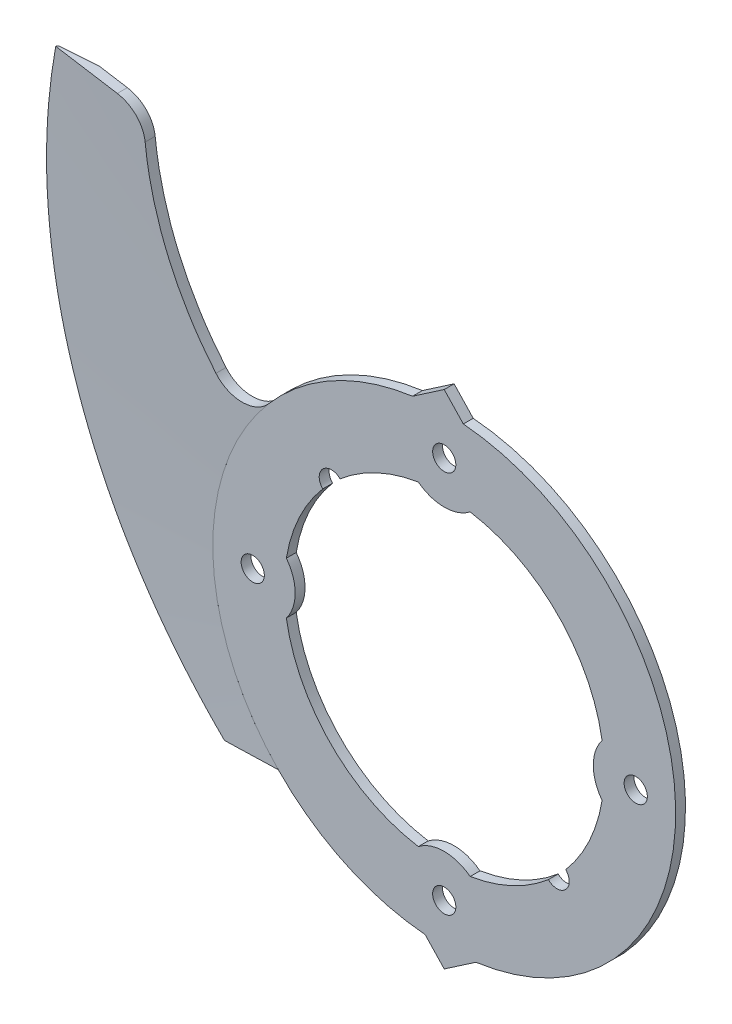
ISO-10303-21;
HEADER;
FILE_DESCRIPTION(('STEP AP214'),'2;1');
FILE_NAME('part.step','',(''),(''),'','','');
FILE_SCHEMA(('AUTOMOTIVE_DESIGN { 1 0 10303 214 1 1 1 1 }'));
ENDSEC;
DATA;
#1=APPLICATION_CONTEXT('core data for automotive mechanical design processes');
#2=APPLICATION_PROTOCOL_DEFINITION('international standard','automotive_design',2000,#1);
#3=PRODUCT_CONTEXT('',#1,'mechanical');
#4=PRODUCT('Part','Part','',(#3));
#5=PRODUCT_RELATED_PRODUCT_CATEGORY('part','',(#4));
#6=PRODUCT_DEFINITION_FORMATION('','',#4);
#7=PRODUCT_DEFINITION_CONTEXT('part definition',#1,'design');
#8=PRODUCT_DEFINITION('design','',#6,#7);
#9=PRODUCT_DEFINITION_SHAPE('','',#8);
#10=(LENGTH_UNIT() NAMED_UNIT(*) SI_UNIT(.MILLI.,.METRE.));
#11=(NAMED_UNIT(*) PLANE_ANGLE_UNIT() SI_UNIT($,.RADIAN.));
#12=(NAMED_UNIT(*) SI_UNIT($,.STERADIAN.) SOLID_ANGLE_UNIT());
#13=UNCERTAINTY_MEASURE_WITH_UNIT(LENGTH_MEASURE(1.E-05),#10,'distance_accuracy_value','');
#14=(GEOMETRIC_REPRESENTATION_CONTEXT(3) GLOBAL_UNCERTAINTY_ASSIGNED_CONTEXT((#13)) GLOBAL_UNIT_ASSIGNED_CONTEXT((#10,
#11,#12)) REPRESENTATION_CONTEXT('',''));
#15=CARTESIAN_POINT('',(0.,0.,0.));
#16=DIRECTION('',(0.,0.,1.));
#17=DIRECTION('',(1.,0.,0.));
#18=AXIS2_PLACEMENT_3D('',#15,#16,#17);
#19=CARTESIAN_POINT('',(2.81403907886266,31.6919290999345,10.));
#20=DIRECTION('',(0.,0.,-1.));
#21=DIRECTION('',(-1.,0.,0.));
#22=AXIS2_PLACEMENT_3D('',#19,#20,#21);
#23=CYLINDRICAL_SURFACE('',#22,29.4703466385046);
#24=DIRECTION('',(0.,0.,-1.));
#25=VECTOR('',#24,1.);
#26=CARTESIAN_POINT('',(-20.7070520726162,13.9363777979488,10.));
#27=LINE('',#26,#25);
#28=CARTESIAN_POINT('',(-20.7070520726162,13.9363777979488,1.05385801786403));
#29=VERTEX_POINT('',#28);
#30=CARTESIAN_POINT('',(-20.7070520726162,13.9363777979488,0.135446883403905));
#31=VERTEX_POINT('',#30);
#32=EDGE_CURVE('E264',#29,#31,#27,.T.);
#33=ORIENTED_EDGE('',*,*,#32,.T.);
#34=CARTESIAN_POINT('',(-20.7069010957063,13.9361777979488,0.135437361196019));
#35=CARTESIAN_POINT('',(-20.9596403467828,14.2709812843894,0.151377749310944));
#36=CARTESIAN_POINT('',(-21.2052003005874,14.6111403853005,0.167244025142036));
#37=CARTESIAN_POINT('',(-21.6815815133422,15.3016305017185,0.198824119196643));
#38=CARTESIAN_POINT('',(-21.9124028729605,15.6519614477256,0.21453793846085));
#39=CARTESIAN_POINT('',(-22.5821638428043,16.7173621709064,0.261442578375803));
#40=CARTESIAN_POINT('',(-22.9984345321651,17.4468851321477,0.292398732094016));
#41=CARTESIAN_POINT('',(-23.7580909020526,18.9210702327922,0.352879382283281));
#42=CARTESIAN_POINT('',(-24.1029647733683,19.6649688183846,0.382420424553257));
#43=CARTESIAN_POINT('',(-24.7294976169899,21.1788173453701,0.440772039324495));
#44=CARTESIAN_POINT('',(-25.0111740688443,21.9487600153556,0.469582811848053));
#45=CARTESIAN_POINT('',(-25.4363665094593,23.2805464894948,0.518089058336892));
#46=CARTESIAN_POINT('',(-25.596179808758,23.8372458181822,0.537981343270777));
#47=CARTESIAN_POINT('',(-25.88274489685,24.9590989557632,0.57735902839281));
#48=CARTESIAN_POINT('',(-26.0094987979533,25.5242522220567,0.59684445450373));
#49=CARTESIAN_POINT('',(-26.2313658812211,26.670733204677,0.63571903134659));
#50=CARTESIAN_POINT('',(-26.3259035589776,27.2521724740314,0.655100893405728));
#51=CARTESIAN_POINT('',(-26.4800150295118,28.4197891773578,0.693411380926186));
#52=CARTESIAN_POINT('',(-26.5395824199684,29.0059674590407,0.712339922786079));
#53=CARTESIAN_POINT('',(-26.581497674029,29.5934177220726,0.731031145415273));
#54=B_SPLINE_CURVE_WITH_KNOTS('',3,(#34,#35,#36,#37,#38,#39,#40,#41,#42,#43,#44,#45,#46,#47,#48,
#49,#50,#51,#52,#53),.UNSPECIFIED.,.F.,.F.,(4,2,2,2,2,2,2,2,2,4),(0.,1.25917033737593,
2.51833207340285,5.0364857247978,7.49521328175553,9.95325994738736,11.6909105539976,
13.4284501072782,15.1955752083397,16.9630237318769),.UNSPECIFIED.);
#55=CARTESIAN_POINT('',(-26.58148339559,29.5932177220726,0.731024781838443));
#56=VERTEX_POINT('',#55);
#57=EDGE_CURVE('E323',#31,#56,#54,.T.);
#58=ORIENTED_EDGE('',*,*,#57,.T.);
#59=DIRECTION('',(0.,0.,-1.));
#60=VECTOR('',#59,1.);
#61=CARTESIAN_POINT('',(-26.58148339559,29.5932177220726,10.));
#62=LINE('',#61,#60);
#63=CARTESIAN_POINT('',(-26.58148339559,29.5932177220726,1.64996771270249));
#64=VERTEX_POINT('',#63);
#65=EDGE_CURVE('E267',#56,#64,#62,.F.);
#66=ORIENTED_EDGE('',*,*,#65,.T.);
#67=CARTESIAN_POINT('',(-20.7069010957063,13.9361777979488,1.05384848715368));
#68=CARTESIAN_POINT('',(-20.9596406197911,14.2709816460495,1.06980312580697));
#69=CARTESIAN_POINT('',(-21.2052008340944,14.6111411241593,1.08568358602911));
#70=CARTESIAN_POINT('',(-21.6815825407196,15.3016320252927,1.11729191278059));
#71=CARTESIAN_POINT('',(-21.9124041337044,15.6519633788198,1.1330197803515));
#72=CARTESIAN_POINT('',(-22.582165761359,16.7173653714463,1.17996635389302));
#73=CARTESIAN_POINT('',(-22.9984368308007,17.44688923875,1.21095018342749));
#74=CARTESIAN_POINT('',(-23.7580938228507,18.9210762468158,1.27148490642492));
#75=CARTESIAN_POINT('',(-24.1029679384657,19.6649758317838,1.30105236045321));
#76=CARTESIAN_POINT('',(-24.7295011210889,21.1788264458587,1.35945614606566));
#77=CARTESIAN_POINT('',(-25.0111776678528,21.9487702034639,1.38829267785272));
#78=CARTESIAN_POINT('',(-25.4363695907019,23.2805569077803,1.4368422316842));
#79=CARTESIAN_POINT('',(-25.5961824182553,23.8372553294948,1.45675224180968));
#80=CARTESIAN_POINT('',(-25.8827466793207,24.9591066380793,1.49616501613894));
#81=CARTESIAN_POINT('',(-26.0095002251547,25.5242589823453,1.51566780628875));
#82=CARTESIAN_POINT('',(-26.2313667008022,26.6707380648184,1.55457702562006));
#83=CARTESIAN_POINT('',(-26.3259041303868,27.252176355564,1.57397615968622));
#84=CARTESIAN_POINT('',(-26.480015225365,28.4197911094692,1.61232078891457));
#85=CARTESIAN_POINT('',(-26.5395824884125,29.0059684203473,1.63126620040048));
#86=CARTESIAN_POINT('',(-26.581497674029,29.5934177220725,1.64997408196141));
#87=B_SPLINE_CURVE_WITH_KNOTS('',3,(#67,#68,#69,#70,#71,#72,#73,#74,#75,#76,#77,#78,#79,#80,#81,
#82,#83,#84,#85,#86),.UNSPECIFIED.,.F.,.F.,(4,2,2,2,2,2,2,2,2,4),(0.,1.25917331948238,
2.51833803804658,5.03649766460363,7.49523109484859,9.95328362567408,11.6909330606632,
13.4284714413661,15.1955952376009,16.963042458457),.UNSPECIFIED.);
#88=EDGE_CURVE('E360',#29,#64,#87,.T.);
#89=ORIENTED_EDGE('',*,*,#88,.F.);
#90=EDGE_LOOP('',(#33,#58,#66,#89));
#91=FACE_BOUND('',#90,.T.);
#92=ADVANCED_FACE('F28',(#91),#23,.F.);
#93=CARTESIAN_POINT('',(-34.4288611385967,33.4214824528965,10.));
#94=DIRECTION('',(0.198105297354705,0.980180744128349,0.));
#95=DIRECTION('',(-0.980180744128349,0.198105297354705,0.));
#96=AXIS2_PLACEMENT_3D('',#93,#94,#95);
#97=PLANE('',#96);
#98=CARTESIAN_POINT('',(-34.3162618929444,33.3986809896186,1.78293555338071));
#99=CARTESIAN_POINT('',(-34.1984396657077,33.3748236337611,1.7486670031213));
#100=CARTESIAN_POINT('',(-34.0806163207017,33.3509718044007,1.71439844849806));
#101=CARTESIAN_POINT('',(-33.8449674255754,33.3032792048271,1.64586133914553));
#102=CARTESIAN_POINT('',(-33.7271418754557,33.2794384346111,1.61159278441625));
#103=CARTESIAN_POINT('',(-33.4914885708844,33.2317679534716,1.54305567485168));
#104=CARTESIAN_POINT('',(-33.3736608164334,33.2079382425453,1.50878712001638));
#105=CARTESIAN_POINT('',(-33.1380031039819,33.1602898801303,1.44025001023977));
#106=CARTESIAN_POINT('',(-33.020173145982,33.1364712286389,1.40598145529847));
#107=CARTESIAN_POINT('',(-32.7845110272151,33.0888449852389,1.33744434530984));
#108=CARTESIAN_POINT('',(-32.6666788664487,33.0650373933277,1.30317579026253));
#109=CARTESIAN_POINT('',(-32.4310123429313,33.0174332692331,1.23463868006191));
#110=CARTESIAN_POINT('',(-32.3131779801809,32.9936367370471,1.2003701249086));
#111=CARTESIAN_POINT('',(-32.0775070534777,32.9460547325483,1.13183301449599));
#112=CARTESIAN_POINT('',(-31.9596704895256,32.9222692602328,1.09756445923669));
#113=CARTESIAN_POINT('',(-31.7239951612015,32.87470937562,1.02902734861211));
#114=CARTESIAN_POINT('',(-31.6061563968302,32.8509349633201,0.994758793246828));
#115=CARTESIAN_POINT('',(-31.4883165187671,32.8271660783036,0.960490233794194));
#116=B_SPLINE_CURVE_WITH_KNOTS('',3,(#98,#99,#100,#101,#102,#103,#104,#105,#106,#107,#108,#109,
#110,#111,#112,#113,#114,#115),.UNSPECIFIED.,.F.,.F.,(4,2,2,2,2,2,2,2,4),(0.,0.375007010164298,
0.750013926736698,1.12502075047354,1.50002748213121,1.87503412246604,2.25004067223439,
2.62504713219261,3.00005350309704),.UNSPECIFIED.);
#117=CARTESIAN_POINT('',(-31.4883166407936,32.8271661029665,0.960486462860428));
#118=VERTEX_POINT('',#117);
#119=CARTESIAN_POINT('',(-34.3162576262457,33.3987020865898,1.78293553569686));
#120=VERTEX_POINT('',#119);
#121=EDGE_CURVE('E612',#118,#120,#116,.F.);
#122=ORIENTED_EDGE('',*,*,#121,.T.);
#123=CARTESIAN_POINT('',(-34.4237387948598,33.4204471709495,1.97982314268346));
#124=CARTESIAN_POINT('',(-34.4192618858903,33.4195419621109,1.97161233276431));
#125=CARTESIAN_POINT('',(-34.4147849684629,33.4186367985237,1.96340152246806));
#126=CARTESIAN_POINT('',(-34.4058311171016,33.4168265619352,1.94697990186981));
#127=CARTESIAN_POINT('',(-34.4013541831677,33.4159214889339,1.93876909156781));
#128=CARTESIAN_POINT('',(-34.3924002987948,33.4141114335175,1.92234747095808));
#129=CARTESIAN_POINT('',(-34.3879233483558,33.4132064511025,1.91413666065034));
#130=CARTESIAN_POINT('',(-34.378969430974,33.411396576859,1.89771504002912));
#131=CARTESIAN_POINT('',(-34.3744924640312,33.4104916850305,1.88950422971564));
#132=CARTESIAN_POINT('',(-34.3655385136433,33.4086819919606,1.87308260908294));
#133=CARTESIAN_POINT('',(-34.3610615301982,33.4077771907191,1.86487179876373));
#134=CARTESIAN_POINT('',(-34.352107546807,33.4059676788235,1.84845017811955));
#135=CARTESIAN_POINT('',(-34.3476305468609,33.4050629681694,1.84023936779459));
#136=CARTESIAN_POINT('',(-34.3386765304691,33.4032536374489,1.82381774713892));
#137=CARTESIAN_POINT('',(-34.3341995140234,33.4023490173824,1.81560693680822));
#138=CARTESIAN_POINT('',(-34.3252454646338,33.4005398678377,1.79918531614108));
#139=CARTESIAN_POINT('',(-34.3207684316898,33.3996353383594,1.79097450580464));
#140=CARTESIAN_POINT('',(-34.3162913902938,33.3987308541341,1.78276369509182));
#141=B_SPLINE_CURVE_WITH_KNOTS('',3,(#123,#124,#125,#126,#127,#128,#129,#130,#131,#132,#133,
#134,#135,#136,#137,#138,#139,#140),.UNSPECIFIED.,.F.,.F.,(4,2,2,2,2,2,2,2,4),(0.,
0.0281871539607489,0.0563743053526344,0.0845614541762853,0.112748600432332,0.14093574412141,
0.16912288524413,0.197310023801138,0.22549715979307),.UNSPECIFIED.);
#142=CARTESIAN_POINT('',(-34.4237387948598,33.4204471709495,1.97982314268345));
#143=VERTEX_POINT('',#142);
#144=EDGE_CURVE('E11',#120,#143,#141,.F.);
#145=ORIENTED_EDGE('',*,*,#144,.T.);
#146=CARTESIAN_POINT('',(-28.9793506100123,32.3200765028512,1.79603352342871));
#147=CARTESIAN_POINT('',(-29.4335055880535,32.4118662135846,1.81097926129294));
#148=CARTESIAN_POINT('',(-29.8876572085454,32.5036552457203,1.82603098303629));
#149=CARTESIAN_POINT('',(-30.7959540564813,32.6872320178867,1.85633170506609));
#150=CARTESIAN_POINT('',(-31.2500992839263,32.7790197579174,1.87158070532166));
#151=CARTESIAN_POINT('',(-32.1583838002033,32.96259403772,1.90226129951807));
#152=CARTESIAN_POINT('',(-32.6125230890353,33.0543805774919,1.91769289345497));
#153=CARTESIAN_POINT('',(-33.5207961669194,33.2379525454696,1.94872581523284));
#154=CARTESIAN_POINT('',(-33.9749299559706,33.3297379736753,1.96432714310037));
#155=CARTESIAN_POINT('',(-34.4290611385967,33.4215228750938,1.98000690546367));
#156=B_SPLINE_CURVE_WITH_KNOTS('',3,(#146,#147,#148,#149,#150,#151,#152,#153,#154,#155),
.UNSPECIFIED.,.F.,.F.,(4,2,2,2,4),(0.,1.39073691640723,2.78147361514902,4.1722102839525,
5.56294717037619),.UNSPECIFIED.);
#157=CARTESIAN_POINT('',(-28.9795506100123,32.3201169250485,1.79604010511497));
#158=VERTEX_POINT('',#157);
#159=EDGE_CURVE('E545',#158,#143,#156,.T.);
#160=ORIENTED_EDGE('',*,*,#159,.F.);
#161=DIRECTION('',(0.,0.,-1.));
#162=VECTOR('',#161,1.);
#163=CARTESIAN_POINT('',(-28.9795506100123,32.3201169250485,10.));
#164=LINE('',#163,#162);
#165=CARTESIAN_POINT('',(-28.9795506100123,32.3201169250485,0.876966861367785));
#166=VERTEX_POINT('',#165);
#167=EDGE_CURVE('E261',#158,#166,#164,.T.);
#168=ORIENTED_EDGE('',*,*,#167,.T.);
#169=CARTESIAN_POINT('',(-28.9793506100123,32.3200765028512,0.876960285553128));
#170=CARTESIAN_POINT('',(-29.4335055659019,32.4118662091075,0.891892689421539));
#171=CARTESIAN_POINT('',(-29.8876571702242,32.5036552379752,0.906930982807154));
#172=CARTESIAN_POINT('',(-30.7959539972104,32.6872320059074,0.937204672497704));
#173=CARTESIAN_POINT('',(-31.2500992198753,32.779019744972,0.952440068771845));
#174=CARTESIAN_POINT('',(-32.1583837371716,32.9625940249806,0.983093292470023));
#175=CARTESIAN_POINT('',(-32.612523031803,33.0543805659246,0.99851111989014));
#176=CARTESIAN_POINT('',(-33.5207961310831,33.2379525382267,1.02951635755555));
#177=CARTESIAN_POINT('',(-33.974929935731,33.3297379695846,1.04510376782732));
#178=CARTESIAN_POINT('',(-34.4290611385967,33.4215228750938,1.06076954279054));
#179=B_SPLINE_CURVE_WITH_KNOTS('',3,(#169,#170,#171,#172,#173,#174,#175,#176,#177,#178),
.UNSPECIFIED.,.F.,.F.,(4,2,2,2,4),(0.,1.39073555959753,2.78147090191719,4.17220621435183,
5.56294174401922),.UNSPECIFIED.);
#180=EDGE_CURVE('E278',#166,#118,#179,.T.);
#181=ORIENTED_EDGE('',*,*,#180,.T.);
#182=EDGE_LOOP('',(#122,#145,#160,#168,#181));
#183=FACE_BOUND('',#182,.T.);
#184=ADVANCED_FACE('F519',(#183),#97,.T.);
#185=CARTESIAN_POINT('',(-19.9446279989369,-14.7431763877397,10.));
#186=DIRECTION('',(0.,1.,0.));
#187=DIRECTION('',(-1.,0.,0.));
#188=AXIS2_PLACEMENT_3D('',#185,#186,#187);
#189=PLANE('',#188);
#190=CARTESIAN_POINT('',(-10.6918975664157,-14.7431763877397,0.782402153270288));
#191=CARTESIAN_POINT('',(-11.4143583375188,-14.7431763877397,0.79947806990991));
#192=CARTESIAN_POINT('',(-12.1367918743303,-14.7431763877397,0.817659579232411));
#193=CARTESIAN_POINT('',(-13.5816089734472,-14.7431763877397,0.855856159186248));
#194=CARTESIAN_POINT('',(-14.3039925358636,-14.7431763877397,0.875871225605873));
#195=CARTESIAN_POINT('',(-15.7487117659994,-14.7431763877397,0.917357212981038));
#196=CARTESIAN_POINT('',(-16.4710474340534,-14.7431763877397,0.938828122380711));
#197=CARTESIAN_POINT('',(-17.9156832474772,-14.7431763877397,0.982944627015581));
#198=CARTESIAN_POINT('',(-18.6379833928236,-14.7431763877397,1.00559022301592));
#199=CARTESIAN_POINT('',(-20.8048292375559,-14.7431763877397,1.07493237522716));
#200=CARTESIAN_POINT('',(-22.2493299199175,-14.7431763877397,1.12303457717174));
#201=CARTESIAN_POINT('',(-24.4160225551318,-14.7431763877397,1.19704412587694));
#202=CARTESIAN_POINT('',(-25.1382466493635,-14.7431763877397,1.22202345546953));
#203=CARTESIAN_POINT('',(-26.5826765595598,-14.7431763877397,1.27250208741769));
#204=CARTESIAN_POINT('',(-27.3048823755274,-14.7431763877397,1.29800138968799));
#205=CARTESIAN_POINT('',(-28.0270807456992,-14.7431763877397,1.32371132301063));
#206=B_SPLINE_CURVE_WITH_KNOTS('',3,(#190,#191,#192,#193,#194,#195,#196,#197,#198,#199,#200,
#201,#202,#203,#204,#205),.UNSPECIFIED.,.F.,.F.,(4,2,2,2,2,2,2,4),(0.,2.16798519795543,
4.33596541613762,6.50392842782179,8.67189285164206,13.0077929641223,15.1757607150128,
17.3437281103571),.UNSPECIFIED.);
#207=CARTESIAN_POINT('',(-15.1644732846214,-14.7431763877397,0.900589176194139));
#208=VERTEX_POINT('',#207);
#209=CARTESIAN_POINT('',(-19.9443078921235,-14.7431763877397,1.03958218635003));
#210=VERTEX_POINT('',#209);
#211=EDGE_CURVE('E585',#208,#210,#206,.T.);
#212=ORIENTED_EDGE('',*,*,#211,.T.);
#213=CARTESIAN_POINT('',(-19.7812944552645,-14.7431763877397,0.83144628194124));
#214=CARTESIAN_POINT('',(-19.7880823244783,-14.7431850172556,0.840114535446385));
#215=CARTESIAN_POINT('',(-19.794870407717,-14.7431923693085,0.848782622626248));
#216=CARTESIAN_POINT('',(-19.8084473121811,-14.7432045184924,0.86611886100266));
#217=CARTESIAN_POINT('',(-19.8152361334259,-14.7432093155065,0.874787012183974));
#218=CARTESIAN_POINT('',(-19.8288145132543,-14.7432163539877,0.89212337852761));
#219=CARTESIAN_POINT('',(-19.8356040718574,-14.7432185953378,0.900791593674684));
#220=CARTESIAN_POINT('',(-19.8491839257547,-14.7432205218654,0.91812808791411));
#221=CARTESIAN_POINT('',(-19.8559742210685,-14.7432202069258,0.9267963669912));
#222=CARTESIAN_POINT('',(-19.8695555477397,-14.7432170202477,0.944132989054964));
#223=CARTESIAN_POINT('',(-19.8763465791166,-14.7432141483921,0.952801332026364));
#224=CARTESIAN_POINT('',(-19.8899293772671,-14.743205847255,0.970138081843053));
#225=CARTESIAN_POINT('',(-19.8967211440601,-14.7432004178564,0.978806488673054));
#226=CARTESIAN_POINT('',(-19.9103054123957,-14.7431870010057,0.996143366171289));
#227=CARTESIAN_POINT('',(-19.9170979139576,-14.7431790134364,1.00481183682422));
#228=CARTESIAN_POINT('',(-19.9306836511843,-14.7431604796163,1.02214884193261));
#229=CARTESIAN_POINT('',(-19.9374768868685,-14.7431499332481,1.03081737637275));
#230=CARTESIAN_POINT('',(-19.9442703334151,-14.7431381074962,1.03948574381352));
#231=B_SPLINE_CURVE_WITH_KNOTS('',3,(#213,#214,#215,#216,#217,#218,#219,#220,#221,#222,#223,
#224,#225,#226,#227,#228,#229,#230),.UNSPECIFIED.,.F.,.F.,(4,2,2,2,2,2,2,2,4),(0.,
0.0330291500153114,0.066059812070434,0.0990919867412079,0.132125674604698,0.16516087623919,
0.19819759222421,0.231235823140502,0.264275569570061),.UNSPECIFIED.);
#232=CARTESIAN_POINT('',(-19.7812427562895,-14.7431765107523,0.831243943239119));
#233=VERTEX_POINT('',#232);
#234=EDGE_CURVE('E590',#210,#233,#231,.F.);
#235=ORIENTED_EDGE('',*,*,#234,.T.);
#236=CARTESIAN_POINT('',(-15.6131013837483,-14.7431763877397,0.));
#237=CARTESIAN_POINT('',(-15.7841285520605,-14.7431764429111,0.0328829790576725));
#238=CARTESIAN_POINT('',(-15.955125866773,-14.7431772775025,0.0659211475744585));
#239=CARTESIAN_POINT('',(-16.2978666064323,-14.7431796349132,0.132456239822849));
#240=CARTESIAN_POINT('',(-16.4696097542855,-14.7431811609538,0.165954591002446));
#241=CARTESIAN_POINT('',(-16.8138518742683,-14.7431840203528,0.233408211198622));
#242=CARTESIAN_POINT('',(-16.9863505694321,-14.7431853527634,0.267364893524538));
#243=CARTESIAN_POINT('',(-17.3321131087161,-14.7431873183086,0.335733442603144));
#244=CARTESIAN_POINT('',(-17.5053766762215,-14.7431879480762,0.370146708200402));
#245=CARTESIAN_POINT('',(-17.8526779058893,-14.7431882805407,0.43942670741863));
#246=CARTESIAN_POINT('',(-18.0267152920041,-14.7431879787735,0.474294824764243));
#247=CARTESIAN_POINT('',(-18.3755727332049,-14.7431865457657,0.544482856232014));
#248=CARTESIAN_POINT('',(-18.5503925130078,-14.74318541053,0.579804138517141));
#249=CARTESIAN_POINT('',(-18.900822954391,-14.7431827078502,0.650896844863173));
#250=CARTESIAN_POINT('',(-19.076433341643,-14.7431811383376,0.686669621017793));
#251=CARTESIAN_POINT('',(-19.4284528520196,-14.7431783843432,0.758663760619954));
#252=CARTESIAN_POINT('',(-19.6048617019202,-14.7431772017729,0.794886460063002));
#253=CARTESIAN_POINT('',(-19.7812427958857,-14.743176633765,0.831243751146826));
#254=B_SPLINE_CURVE_WITH_KNOTS('',3,(#236,#237,#238,#239,#240,#241,#242,#243,#244,#245,#246,
#247,#248,#249,#250,#251,#252,#253),.UNSPECIFIED.,.F.,.F.,(4,2,2,2,2,2,2,2,4),(0.,
0.522478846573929,1.04741726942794,1.57484445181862,2.10478837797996,2.63727586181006,
3.17233257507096,3.70998307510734,4.25025083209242),.UNSPECIFIED.);
#255=CARTESIAN_POINT('',(-15.6131013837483,-14.7431763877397,0.));
#256=VERTEX_POINT('',#255);
#257=EDGE_CURVE('E598',#233,#256,#254,.F.);
#258=ORIENTED_EDGE('',*,*,#257,.T.);
#259=DIRECTION('',(1.,0.,0.));
#260=VECTOR('',#259,1.);
#261=CARTESIAN_POINT('',(-19.9446279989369,-14.7431763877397,0.));
#262=LINE('',#261,#260);
#263=CARTESIAN_POINT('',(-15.1644732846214,-14.7431763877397,0.));
#264=VERTEX_POINT('',#263);
#265=EDGE_CURVE('E496',#256,#264,#262,.T.);
#266=ORIENTED_EDGE('',*,*,#265,.T.);
#267=DIRECTION('',(0.,0.,-1.));
#268=VECTOR('',#267,1.);
#269=CARTESIAN_POINT('',(-15.1644732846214,-14.7431763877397,10.));
#270=LINE('',#269,#268);
#271=CARTESIAN_POINT('',(-15.1644732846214,-14.7431763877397,0.900000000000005));
#272=VERTEX_POINT('',#271);
#273=EDGE_CURVE('E256',#272,#264,#270,.T.);
#274=ORIENTED_EDGE('',*,*,#273,.F.);
#275=EDGE_CURVE('E257',#208,#272,#270,.T.);
#276=ORIENTED_EDGE('',*,*,#275,.F.);
#277=EDGE_LOOP('',(#212,#235,#258,#266,#274,#276));
#278=FACE_BOUND('',#277,.T.);
#279=ADVANCED_FACE('F345',(#278),#189,.F.);
#280=CARTESIAN_POINT('',(-29.5738665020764,29.3795746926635,10.));
#281=DIRECTION('',(0.,0.,-1.));
#282=DIRECTION('',(-1.,0.,0.));
#283=AXIS2_PLACEMENT_3D('',#280,#281,#282);
#284=CYLINDRICAL_SURFACE('',#283,3.);
#285=ORIENTED_EDGE('',*,*,#65,.F.);
#286=CARTESIAN_POINT('',(-26.5814691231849,29.5930177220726,0.731018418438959));
#287=CARTESIAN_POINT('',(-26.5874680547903,29.67723409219,0.733697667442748));
#288=CARTESIAN_POINT('',(-26.5970377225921,29.7611888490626,0.736468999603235));
#289=CARTESIAN_POINT('',(-26.623212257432,29.9279847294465,0.742172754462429));
#290=CARTESIAN_POINT('',(-26.6398167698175,30.01082590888,0.745105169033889));
#291=CARTESIAN_POINT('',(-26.6799450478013,30.1747707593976,0.751106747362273));
#292=CARTESIAN_POINT('',(-26.7034652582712,30.2558753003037,0.754175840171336));
#293=CARTESIAN_POINT('',(-26.757240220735,30.41579020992,0.760426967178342));
#294=CARTESIAN_POINT('',(-26.7874948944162,30.4946006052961,0.76360900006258));
#295=CARTESIAN_POINT('',(-26.8880998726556,30.7268144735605,0.773291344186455));
#296=CARTESIAN_POINT('',(-26.9683110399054,30.8760816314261,0.779930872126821));
#297=CARTESIAN_POINT('',(-27.1525965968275,31.158892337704,0.793365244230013));
#298=CARTESIAN_POINT('',(-27.2566641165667,31.2924403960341,0.800160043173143));
#299=CARTESIAN_POINT('',(-27.4858079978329,31.5402426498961,0.813719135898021));
#300=CARTESIAN_POINT('',(-27.6108937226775,31.6544882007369,0.820483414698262));
#301=CARTESIAN_POINT('',(-27.8785072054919,31.8603531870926,0.833790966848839));
#302=CARTESIAN_POINT('',(-28.0210366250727,31.9519704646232,0.840334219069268));
#303=CARTESIAN_POINT('',(-28.2973653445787,32.0982572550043,0.852083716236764));
#304=CARTESIAN_POINT('',(-28.4293353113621,32.1563880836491,0.857344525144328));
#305=CARTESIAN_POINT('',(-28.6323861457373,32.2289236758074,0.864940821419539));
#306=CARTESIAN_POINT('',(-28.7009144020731,32.2506578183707,0.867423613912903));
#307=CARTESIAN_POINT('',(-28.8393666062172,32.289157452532,0.872281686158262));
#308=CARTESIAN_POINT('',(-28.9092907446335,32.3059222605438,0.874656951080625));
#309=CARTESIAN_POINT('',(-28.9797506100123,32.3201573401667,0.876973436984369));
#310=B_SPLINE_CURVE_WITH_KNOTS('',3,(#286,#287,#288,#289,#290,#291,#292,#293,#294,#295,#296,
#297,#298,#299,#300,#301,#302,#303,#304,#305,#306,#307,#308,#309),.UNSPECIFIED.,.F.,.F.,(4,2,2,
2,2,2,2,2,2,2,2,4),(0.,0.253334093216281,0.506655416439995,0.759846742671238,1.01303512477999,
1.51916464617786,2.02514859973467,2.53135856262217,3.03761678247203,3.46895746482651,
3.68459947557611,3.90027113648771),.UNSPECIFIED.);
#311=EDGE_CURVE('E328',#56,#166,#310,.T.);
#312=ORIENTED_EDGE('',*,*,#311,.T.);
#313=ORIENTED_EDGE('',*,*,#167,.F.);
#314=CARTESIAN_POINT('',(-26.5814691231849,29.5930177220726,1.64996134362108));
#315=CARTESIAN_POINT('',(-26.587468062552,29.6772342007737,1.65264298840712));
#316=CARTESIAN_POINT('',(-26.5970377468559,29.7611890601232,1.65541679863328));
#317=CARTESIAN_POINT('',(-26.6232123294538,29.9279851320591,1.66112565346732));
#318=CARTESIAN_POINT('',(-26.6398168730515,30.0108264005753,1.66406068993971));
#319=CARTESIAN_POINT('',(-26.679945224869,30.1747714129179,1.67006763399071));
#320=CARTESIAN_POINT('',(-26.7034654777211,30.2558760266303,1.67313947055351));
#321=CARTESIAN_POINT('',(-26.757240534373,30.4157910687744,1.67939618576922));
#322=CARTESIAN_POINT('',(-26.7874952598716,30.4946015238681,1.68258106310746));
#323=CARTESIAN_POINT('',(-26.888100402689,30.7268155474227,1.6922720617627));
#324=CARTESIAN_POINT('',(-26.9683116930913,30.8760827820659,1.69891752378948));
#325=CARTESIAN_POINT('',(-27.1525975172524,31.1588936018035,1.71236390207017));
#326=CARTESIAN_POINT('',(-27.2566651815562,31.2924416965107,1.71916477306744));
#327=CARTESIAN_POINT('',(-27.4858094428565,31.5402440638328,1.73273598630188));
#328=CARTESIAN_POINT('',(-27.610895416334,31.6544896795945,1.73950631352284));
#329=CARTESIAN_POINT('',(-27.8785094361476,31.8603547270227,1.75282576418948));
#330=CARTESIAN_POINT('',(-28.0210391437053,31.9519720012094,1.75937486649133));
#331=CARTESIAN_POINT('',(-28.2973677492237,32.0982583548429,1.77113483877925));
#332=CARTESIAN_POINT('',(-28.4293372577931,32.1563888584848,1.77640032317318));
#333=CARTESIAN_POINT('',(-28.6323873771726,32.2289240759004,1.78400337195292));
#334=CARTESIAN_POINT('',(-28.7009153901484,32.2506581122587,1.78648837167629));
#335=CARTESIAN_POINT('',(-28.8393671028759,32.2891575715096,1.79135076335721));
#336=CARTESIAN_POINT('',(-28.909290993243,32.3059223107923,1.79372814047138));
#337=CARTESIAN_POINT('',(-28.9797506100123,32.3201573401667,1.79604668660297));
#338=B_SPLINE_CURVE_WITH_KNOTS('',3,(#314,#315,#316,#317,#318,#319,#320,#321,#322,#323,#324,
#325,#326,#327,#328,#329,#330,#331,#332,#333,#334,#335,#336,#337),.UNSPECIFIED.,.F.,.F.,(4,2,2,
2,2,2,2,2,2,2,2,4),(0.,0.253334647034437,0.506656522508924,0.759848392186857,1.01303731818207,
1.51916791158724,2.02515294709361,2.53136430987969,3.03762391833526,3.46896348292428,
3.68460493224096,3.90027603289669),.UNSPECIFIED.);
#339=EDGE_CURVE('E353',#64,#158,#338,.T.);
#340=ORIENTED_EDGE('',*,*,#339,.F.);
#341=EDGE_LOOP('',(#285,#312,#313,#340));
#342=FACE_BOUND('',#341,.T.);
#343=ADVANCED_FACE('F340',(#342),#284,.T.);
#344=CARTESIAN_POINT('',(-18.3126698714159,15.7438439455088,10.));
#345=DIRECTION('',(0.,0.,-1.));
#346=DIRECTION('',(-1.,0.,0.));
#347=AXIS2_PLACEMENT_3D('',#344,#345,#346);
#348=CYLINDRICAL_SURFACE('',#347,3.);
#349=CARTESIAN_POINT('',(-20.7072030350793,13.9365777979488,0.135456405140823));
#350=CARTESIAN_POINT('',(-20.6563404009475,13.8691740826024,0.132247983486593));
#351=CARTESIAN_POINT('',(-20.6026226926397,13.8039322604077,0.128994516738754));
#352=CARTESIAN_POINT('',(-20.4898869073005,13.6782102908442,0.122419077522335));
#353=CARTESIAN_POINT('',(-20.4308690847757,13.6177299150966,0.119097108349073));
#354=CARTESIAN_POINT('',(-20.3079714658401,13.5019937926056,0.11240776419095));
#355=CARTESIAN_POINT('',(-20.244094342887,13.4467352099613,0.109040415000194));
#356=CARTESIAN_POINT('',(-20.1119338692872,13.3418077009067,0.102282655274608));
#357=CARTESIAN_POINT('',(-20.043650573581,13.2921387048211,0.0988922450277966));
#358=CARTESIAN_POINT('',(-19.8328310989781,13.1520256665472,0.0887183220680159));
#359=CARTESIAN_POINT('',(-19.6842655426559,13.0704193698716,0.0819288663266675));
#360=CARTESIAN_POINT('',(-19.3756393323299,12.9333928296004,0.0685516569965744));
#361=CARTESIAN_POINT('',(-19.2155813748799,12.8779664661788,0.0619638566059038));
#362=CARTESIAN_POINT('',(-18.8883775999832,12.7947678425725,0.0491891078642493));
#363=CARTESIAN_POINT('',(-18.7212307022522,12.7669998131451,0.0430022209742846));
#364=CARTESIAN_POINT('',(-18.3846065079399,12.7399588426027,0.031237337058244));
#365=CARTESIAN_POINT('',(-18.215129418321,12.7406833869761,0.0256592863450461));
#366=CARTESIAN_POINT('',(-17.9174736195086,12.7671457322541,0.0165038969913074));
#367=CARTESIAN_POINT('',(-17.7887549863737,12.7870967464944,0.0127613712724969));
#368=CARTESIAN_POINT('',(-17.5351140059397,12.8434439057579,0.00584026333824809));
#369=CARTESIAN_POINT('',(-17.4101873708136,12.8798206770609,0.00266102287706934));
#370=CARTESIAN_POINT('',(-17.288112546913,12.9242194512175,-0.000199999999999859));
#371=B_SPLINE_CURVE_WITH_KNOTS('',3,(#349,#350,#351,#352,#353,#354,#355,#356,#357,#358,#359,
#360,#361,#362,#363,#364,#365,#366,#367,#368,#369,#370),.UNSPECIFIED.,.F.,.F.,(4,2,2,2,2,2,2,2,
2,2,4),(0.,0.253422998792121,0.506833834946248,0.760106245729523,1.0133754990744,
1.51967073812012,2.02584756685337,2.532101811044,3.03831137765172,3.42818442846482,
3.81759883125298),.UNSPECIFIED.);
#372=CARTESIAN_POINT('',(-17.2966255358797,12.9211406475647,0.));
#373=VERTEX_POINT('',#372);
#374=EDGE_CURVE('E316',#31,#373,#371,.T.);
#375=ORIENTED_EDGE('',*,*,#374,.F.);
#376=ORIENTED_EDGE('',*,*,#32,.F.);
#377=CARTESIAN_POINT('',(-20.7072030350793,13.9365777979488,1.05386754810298));
#378=CARTESIAN_POINT('',(-20.6563366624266,13.86916913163,1.05065602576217));
#379=CARTESIAN_POINT('',(-20.6026147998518,13.8039226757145,1.04739941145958));
#380=CARTESIAN_POINT('',(-20.4898700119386,13.6781922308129,1.04081761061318));
#381=CARTESIAN_POINT('',(-20.4308473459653,13.617708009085,1.03749242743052));
#382=CARTESIAN_POINT('',(-20.3079481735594,13.5019732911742,1.03079708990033));
#383=CARTESIAN_POINT('',(-20.2440750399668,13.44671921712,1.02742696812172));
#384=CARTESIAN_POINT('',(-20.111923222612,13.341799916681,1.02066364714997));
#385=CARTESIAN_POINT('',(-20.0436445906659,13.2921346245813,1.01727044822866));
#386=CARTESIAN_POINT('',(-19.8328326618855,13.152026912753,1.00708781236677));
#387=CARTESIAN_POINT('',(-19.684269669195,13.0704222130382,1.00029241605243));
#388=CARTESIAN_POINT('',(-19.3756450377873,12.933394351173,0.986903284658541));
#389=CARTESIAN_POINT('',(-19.2155855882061,12.8779662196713,0.980309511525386));
#390=CARTESIAN_POINT('',(-18.8883862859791,12.7947713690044,0.967523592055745));
#391=CARTESIAN_POINT('',(-18.7212461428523,12.7670057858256,0.961331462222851));
#392=CARTESIAN_POINT('',(-18.3846446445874,12.7399571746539,0.949556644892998));
#393=CARTESIAN_POINT('',(-18.2151830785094,12.7406767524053,0.943974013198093));
#394=CARTESIAN_POINT('',(-17.8788882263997,12.7705779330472,0.933620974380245));
#395=CARTESIAN_POINT('',(-17.7120531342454,12.7997390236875,0.928849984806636));
#396=CARTESIAN_POINT('',(-17.3855769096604,12.8856990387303,0.920293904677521));
#397=CARTESIAN_POINT('',(-17.2259377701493,12.9425055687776,0.916509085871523));
#398=CARTESIAN_POINT('',(-16.9185179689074,13.0821049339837,0.910077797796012));
#399=CARTESIAN_POINT('',(-16.7707342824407,13.1648911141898,0.907431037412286));
#400=CARTESIAN_POINT('',(-16.491308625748,13.3540711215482,0.90338640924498));
#401=CARTESIAN_POINT('',(-16.3596410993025,13.4604268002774,0.901986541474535));
#402=CARTESIAN_POINT('',(-16.2028602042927,13.6105174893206,0.901020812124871));
#403=CARTESIAN_POINT('',(-16.1685739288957,13.6449817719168,0.900858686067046));
#404=CARTESIAN_POINT('',(-16.1017690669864,13.7154790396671,0.900642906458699));
#405=CARTESIAN_POINT('',(-16.0692477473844,13.7515094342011,0.900589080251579));
#406=CARTESIAN_POINT('',(-16.0376040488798,13.7883195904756,0.900589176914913));
#407=B_SPLINE_CURVE_WITH_KNOTS('',3,(#377,#378,#379,#380,#381,#382,#383,#384,#385,#386,#387,
#388,#389,#390,#391,#392,#393,#394,#395,#396,#397,#398,#399,#400,#401,#402,#403,#404,#405,#406),
.UNSPECIFIED.,.F.,.F.,(4,2,2,2,2,2,2,2,2,2,2,2,2,2,4),(0.,0.253441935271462,0.506871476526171,
0.760126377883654,1.01337830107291,1.51966380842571,2.02585316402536,2.53206330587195,
3.03831975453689,3.54421135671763,4.05024221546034,4.55614355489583,5.06123197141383,
5.20703733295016,5.35261006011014),.UNSPECIFIED.);
#408=CARTESIAN_POINT('',(-16.0378040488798,13.7880869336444,0.900589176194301));
#409=VERTEX_POINT('',#408);
#410=EDGE_CURVE('E592',#29,#409,#407,.T.);
#411=ORIENTED_EDGE('',*,*,#410,.T.);
#412=DIRECTION('',(0.,0.,-1.));
#413=VECTOR('',#412,1.);
#414=CARTESIAN_POINT('',(-16.0378040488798,13.7880869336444,10.));
#415=LINE('',#414,#413);
#416=CARTESIAN_POINT('',(-16.0378040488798,13.7880869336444,0.9));
#417=VERTEX_POINT('',#416);
#418=EDGE_CURVE('E269',#417,#409,#415,.F.);
#419=ORIENTED_EDGE('',*,*,#418,.F.);
#420=CARTESIAN_POINT('',(-16.0378040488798,13.7880869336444,0.));
#421=VERTEX_POINT('',#420);
#422=EDGE_CURVE('E270',#421,#417,#415,.F.);
#423=ORIENTED_EDGE('',*,*,#422,.F.);
#424=CARTESIAN_POINT('',(-18.3126698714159,15.7438439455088,0.));
#425=DIRECTION('',(0.,0.,1.));
#426=DIRECTION('',(1.,0.,0.));
#427=AXIS2_PLACEMENT_3D('',#424,#425,#426);
#428=CIRCLE('',#427,3.);
#429=EDGE_CURVE('E273',#373,#421,#428,.T.);
#430=ORIENTED_EDGE('',*,*,#429,.F.);
#431=EDGE_LOOP('',(#375,#376,#411,#419,#423,#430));
#432=FACE_BOUND('',#431,.T.);
#433=ADVANCED_FACE('F344',(#432),#348,.F.);
#434=CARTESIAN_POINT('',(-1.60913199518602E-13,22.93,10.));
#435=DIRECTION('',(0.564359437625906,-0.825529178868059,0.));
#436=DIRECTION('',(0.825529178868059,0.564359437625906,0.));
#437=AXIS2_PLACEMENT_3D('',#434,#435,#436);
#438=PLANE('',#437);
#439=DIRECTION('',(0.,0.,-1.));
#440=VECTOR('',#439,1.);
#441=CARTESIAN_POINT('',(-1.60913199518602E-13,22.93,10.));
#442=LINE('',#441,#440);
#443=CARTESIAN_POINT('',(-1.60913199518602E-13,22.93,0.900000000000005));
#444=VERTEX_POINT('',#443);
#445=CARTESIAN_POINT('',(-1.60913199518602E-13,22.93,0.));
#446=VERTEX_POINT('',#445);
#447=EDGE_CURVE('E215',#444,#446,#442,.T.);
#448=ORIENTED_EDGE('',*,*,#447,.T.);
#449=DIRECTION('',(-0.825529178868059,-0.564359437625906,0.));
#450=VECTOR('',#449,1.);
#451=CARTESIAN_POINT('',(-1.60913199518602E-13,22.93,0.));
#452=LINE('',#451,#450);
#453=CARTESIAN_POINT('',(-2.89490965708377,20.9509426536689,0.));
#454=VERTEX_POINT('',#453);
#455=EDGE_CURVE('E219',#446,#454,#452,.T.);
#456=ORIENTED_EDGE('',*,*,#455,.T.);
#457=DIRECTION('',(0.,0.,-1.));
#458=VECTOR('',#457,1.);
#459=CARTESIAN_POINT('',(-2.89490965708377,20.9509426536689,10.));
#460=LINE('',#459,#458);
#461=CARTESIAN_POINT('',(-2.89490965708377,20.9509426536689,0.900000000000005));
#462=VERTEX_POINT('',#461);
#463=EDGE_CURVE('E259',#462,#454,#460,.T.);
#464=ORIENTED_EDGE('',*,*,#463,.F.);
#465=DIRECTION('',(0.825529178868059,0.564359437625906,0.));
#466=VECTOR('',#465,1.);
#467=CARTESIAN_POINT('',(-1.60913199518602E-13,22.93,0.900000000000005));
#468=LINE('',#467,#466);
#469=EDGE_CURVE('E221',#462,#444,#468,.T.);
#470=ORIENTED_EDGE('',*,*,#469,.T.);
#471=EDGE_LOOP('',(#448,#456,#464,#470));
#472=FACE_BOUND('',#471,.T.);
#473=ADVANCED_FACE('F217',(#472),#438,.F.);
#474=CARTESIAN_POINT('',(0.,-22.93,10.));
#475=DIRECTION('',(-0.727303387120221,-0.686316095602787,0.));
#476=DIRECTION('',(0.686316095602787,-0.727303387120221,0.));
#477=AXIS2_PLACEMENT_3D('',#474,#475,#476);
#478=PLANE('',#477);
#479=DIRECTION('',(-0.686316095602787,0.727303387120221,0.));
#480=VECTOR('',#479,1.);
#481=CARTESIAN_POINT('',(0.,-22.93,0.));
#482=LINE('',#481,#480);
#483=CARTESIAN_POINT('',(0.,-22.93,0.));
#484=VERTEX_POINT('',#483);
#485=CARTESIAN_POINT('',(-1.74796528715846,-21.0776449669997,0.));
#486=VERTEX_POINT('',#485);
#487=EDGE_CURVE('E725',#484,#486,#482,.T.);
#488=ORIENTED_EDGE('',*,*,#487,.F.);
#489=DIRECTION('',(0.,0.,-1.));
#490=VECTOR('',#489,1.);
#491=CARTESIAN_POINT('',(0.,-22.93,10.));
#492=LINE('',#491,#490);
#493=CARTESIAN_POINT('',(0.,-22.93,0.900000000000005));
#494=VERTEX_POINT('',#493);
#495=EDGE_CURVE('E251',#494,#484,#492,.T.);
#496=ORIENTED_EDGE('',*,*,#495,.F.);
#497=DIRECTION('',(0.686316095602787,-0.727303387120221,0.));
#498=VECTOR('',#497,1.);
#499=CARTESIAN_POINT('',(0.,-22.93,0.900000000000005));
#500=LINE('',#499,#498);
#501=CARTESIAN_POINT('',(-1.74796528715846,-21.0776449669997,0.900000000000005));
#502=VERTEX_POINT('',#501);
#503=EDGE_CURVE('E370',#502,#494,#500,.T.);
#504=ORIENTED_EDGE('',*,*,#503,.F.);
#505=DIRECTION('',(0.,0.,-1.));
#506=VECTOR('',#505,1.);
#507=CARTESIAN_POINT('',(-1.74796528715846,-21.0776449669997,10.));
#508=LINE('',#507,#506);
#509=EDGE_CURVE('E253',#502,#486,#508,.T.);
#510=ORIENTED_EDGE('',*,*,#509,.T.);
#511=EDGE_LOOP('',(#488,#496,#504,#510));
#512=FACE_BOUND('',#511,.T.);
#513=ADVANCED_FACE('F734',(#512),#478,.T.);
#514=CARTESIAN_POINT('',(0.,-22.93,10.));
#515=DIRECTION('',(-0.5643594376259,0.825529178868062,0.));
#516=DIRECTION('',(-0.825529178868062,-0.5643594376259,0.));
#517=AXIS2_PLACEMENT_3D('',#514,#515,#516);
#518=PLANE('',#517);
#519=ORIENTED_EDGE('',*,*,#495,.T.);
#520=DIRECTION('',(0.825529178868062,0.5643594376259,0.));
#521=VECTOR('',#520,1.);
#522=CARTESIAN_POINT('',(0.,-22.93,0.));
#523=LINE('',#522,#521);
#524=CARTESIAN_POINT('',(2.89490965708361,-20.9509426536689,0.));
#525=VERTEX_POINT('',#524);
#526=EDGE_CURVE('E243',#484,#525,#523,.T.);
#527=ORIENTED_EDGE('',*,*,#526,.T.);
#528=DIRECTION('',(0.,0.,-1.));
#529=VECTOR('',#528,1.);
#530=CARTESIAN_POINT('',(2.89490965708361,-20.9509426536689,10.));
#531=LINE('',#530,#529);
#532=CARTESIAN_POINT('',(2.89490965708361,-20.9509426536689,0.900000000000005));
#533=VERTEX_POINT('',#532);
#534=EDGE_CURVE('E248',#533,#525,#531,.T.);
#535=ORIENTED_EDGE('',*,*,#534,.F.);
#536=DIRECTION('',(-0.825529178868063,-0.5643594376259,0.));
#537=VECTOR('',#536,1.);
#538=CARTESIAN_POINT('',(0.,-22.93,0.900000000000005));
#539=LINE('',#538,#537);
#540=EDGE_CURVE('E373',#533,#494,#539,.T.);
#541=ORIENTED_EDGE('',*,*,#540,.T.);
#542=EDGE_LOOP('',(#519,#527,#535,#541));
#543=FACE_BOUND('',#542,.T.);
#544=ADVANCED_FACE('F735',(#543),#518,.F.);
#545=CARTESIAN_POINT('',(-1.60913199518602E-13,22.93,10.));
#546=DIRECTION('',(0.727303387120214,0.686316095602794,0.));
#547=DIRECTION('',(-0.686316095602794,0.727303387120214,0.));
#548=AXIS2_PLACEMENT_3D('',#545,#546,#547);
#549=PLANE('',#548);
#550=DIRECTION('',(0.686316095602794,-0.727303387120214,0.));
#551=VECTOR('',#550,1.);
#552=CARTESIAN_POINT('',(-1.60913199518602E-13,22.93,0.));
#553=LINE('',#552,#551);
#554=CARTESIAN_POINT('',(1.74796528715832,21.0776449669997,0.));
#555=VERTEX_POINT('',#554);
#556=EDGE_CURVE('E226',#446,#555,#553,.T.);
#557=ORIENTED_EDGE('',*,*,#556,.F.);
#558=ORIENTED_EDGE('',*,*,#447,.F.);
#559=DIRECTION('',(-0.686316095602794,0.727303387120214,0.));
#560=VECTOR('',#559,1.);
#561=CARTESIAN_POINT('',(-1.60913199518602E-13,22.93,0.900000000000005));
#562=LINE('',#561,#560);
#563=CARTESIAN_POINT('',(1.74796528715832,21.0776449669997,0.900000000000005));
#564=VERTEX_POINT('',#563);
#565=EDGE_CURVE('E359',#564,#444,#562,.T.);
#566=ORIENTED_EDGE('',*,*,#565,.F.);
#567=DIRECTION('',(0.,0.,-1.));
#568=VECTOR('',#567,1.);
#569=CARTESIAN_POINT('',(1.74796528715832,21.0776449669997,10.));
#570=LINE('',#569,#568);
#571=EDGE_CURVE('E225',#564,#555,#570,.T.);
#572=ORIENTED_EDGE('',*,*,#571,.T.);
#573=EDGE_LOOP('',(#557,#558,#566,#572));
#574=FACE_BOUND('',#573,.T.);
#575=ADVANCED_FACE('F238',(#574),#549,.T.);
#576=CARTESIAN_POINT('',(0.,0.,0.));
#577=DIRECTION('',(0.,0.,1.));
#578=DIRECTION('',(1.,0.,0.));
#579=AXIS2_PLACEMENT_3D('',#576,#577,#578);
#580=PLANE('',#579);
#581=CARTESIAN_POINT('',(0.,0.,0.));
#582=DIRECTION('',(0.,0.,1.));
#583=DIRECTION('',(1.,0.,0.));
#584=AXIS2_PLACEMENT_3D('',#581,#582,#583);
#585=CIRCLE('',#584,21.15);
#586=EDGE_CURVE('E235',#454,#421,#585,.T.);
#587=ORIENTED_EDGE('',*,*,#586,.F.);
#588=ORIENTED_EDGE('',*,*,#455,.F.);
#589=ORIENTED_EDGE('',*,*,#556,.T.);
#590=CARTESIAN_POINT('',(0.,0.,0.));
#591=DIRECTION('',(0.,0.,1.));
#592=DIRECTION('',(1.,0.,0.));
#593=AXIS2_PLACEMENT_3D('',#590,#591,#592);
#594=CIRCLE('',#593,21.15);
#595=EDGE_CURVE('E241',#525,#555,#594,.T.);
#596=ORIENTED_EDGE('',*,*,#595,.F.);
#597=ORIENTED_EDGE('',*,*,#526,.F.);
#598=ORIENTED_EDGE('',*,*,#487,.T.);
#599=CARTESIAN_POINT('',(0.,0.,0.));
#600=DIRECTION('',(0.,0.,1.));
#601=DIRECTION('',(1.,0.,0.));
#602=AXIS2_PLACEMENT_3D('',#599,#600,#601);
#603=CIRCLE('',#602,21.15);
#604=EDGE_CURVE('E499',#264,#486,#603,.T.);
#605=ORIENTED_EDGE('',*,*,#604,.F.);
#606=ORIENTED_EDGE('',*,*,#265,.F.);
#607=CARTESIAN_POINT('',(-16.5528061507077,-13.8608441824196,0.));
#608=CARTESIAN_POINT('',(-16.5141418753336,-13.8980858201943,-3.63841647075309E-05));
#609=CARTESIAN_POINT('',(-16.4754182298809,-13.935265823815,-6.8266238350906E-05));
#610=CARTESIAN_POINT('',(-16.397847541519,-14.0095071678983,-0.000122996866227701));
#611=CARTESIAN_POINT('',(-16.3590004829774,-14.0465684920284,-0.000145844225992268));
#612=CARTESIAN_POINT('',(-16.2811831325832,-14.1205723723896,-0.000182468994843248));
#613=CARTESIAN_POINT('',(-16.2422128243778,-14.1575149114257,-0.00019624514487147));
#614=CARTESIAN_POINT('',(-16.1641491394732,-14.231281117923,-0.000214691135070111));
#615=CARTESIAN_POINT('',(-16.1250557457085,-14.2681047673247,-0.000219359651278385));
#616=CARTESIAN_POINT('',(-16.0467460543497,-14.3416330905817,-0.000219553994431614));
#617=CARTESIAN_POINT('',(-16.0075297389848,-14.3783377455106,-0.000215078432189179));
#618=CARTESIAN_POINT('',(-15.9289743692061,-14.4516279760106,-0.000196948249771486));
#619=CARTESIAN_POINT('',(-15.889635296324,-14.4882135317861,-0.000183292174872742));
#620=CARTESIAN_POINT('',(-15.8108345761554,-14.5612654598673,-0.000146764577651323));
#621=CARTESIAN_POINT('',(-15.7713729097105,-14.597731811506,-0.000123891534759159));
#622=CARTESIAN_POINT('',(-15.6923271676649,-14.6705452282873,-6.88936864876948E-05));
#623=CARTESIAN_POINT('',(-15.6527430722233,-14.7068922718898,-3.67672944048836E-05));
#624=CARTESIAN_POINT('',(-15.6131013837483,-14.7431763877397,0.));
#625=B_SPLINE_CURVE_WITH_KNOTS('',3,(#607,#608,#609,#610,#611,#612,#613,#614,#615,#616,#617,
#618,#619,#620,#621,#622,#623,#624),.UNSPECIFIED.,.F.,.F.,(4,2,2,2,2,2,2,2,4),(0.,
0.161049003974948,0.322119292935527,0.483211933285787,0.64432798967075,0.805468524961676,
0.966634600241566,1.12782727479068,1.28904760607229),.UNSPECIFIED.);
#626=CARTESIAN_POINT('',(-16.5529968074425,-13.8610038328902,0.));
#627=VERTEX_POINT('',#626);
#628=EDGE_CURVE('E630',#256,#627,#625,.F.);
#629=ORIENTED_EDGE('',*,*,#628,.T.);
#630=CARTESIAN_POINT('',(2.38035630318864E-12,0.,0.));
#631=DIRECTION('',(0.,0.,1.));
#632=DIRECTION('',(1.,0.,0.));
#633=AXIS2_PLACEMENT_3D('',#630,#631,#632);
#634=CIRCLE('',#633,21.5900238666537);
#635=EDGE_CURVE('E275',#373,#627,#634,.T.);
#636=ORIENTED_EDGE('',*,*,#635,.F.);
#637=ORIENTED_EDGE('',*,*,#429,.T.);
#638=EDGE_LOOP('',(#587,#588,#589,#596,#597,#598,#605,#606,#629,#636,#637));
#639=FACE_BOUND('',#638,.T.);
#640=CARTESIAN_POINT('',(1.83302876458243E-13,17.5,0.));
#641=DIRECTION('',(0.,0.,1.));
#642=DIRECTION('',(1.,0.,0.));
#643=AXIS2_PLACEMENT_3D('',#640,#641,#642);
#644=CIRCLE('',#643,1.06);
#645=CARTESIAN_POINT('',(1.06000000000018,17.5,0.));
#646=VERTEX_POINT('',#645);
#647=EDGE_CURVE('E484',#646,#646,#644,.T.);
#648=ORIENTED_EDGE('',*,*,#647,.T.);
#649=EDGE_LOOP('',(#648));
#650=FACE_BOUND('',#649,.T.);
#651=CARTESIAN_POINT('',(0.,-17.5,0.));
#652=DIRECTION('',(0.,0.,1.));
#653=DIRECTION('',(1.,0.,0.));
#654=AXIS2_PLACEMENT_3D('',#651,#652,#653);
#655=CIRCLE('',#654,1.06);
#656=CARTESIAN_POINT('',(1.05999999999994,-17.5,0.));
#657=VERTEX_POINT('',#656);
#658=EDGE_CURVE('E490',#657,#657,#655,.T.);
#659=ORIENTED_EDGE('',*,*,#658,.T.);
#660=EDGE_LOOP('',(#659));
#661=FACE_BOUND('',#660,.T.);
#662=CARTESIAN_POINT('',(17.5,0.,0.));
#663=DIRECTION('',(0.,0.,1.));
#664=DIRECTION('',(1.,0.,0.));
#665=AXIS2_PLACEMENT_3D('',#662,#663,#664);
#666=CIRCLE('',#665,1.06);
#667=CARTESIAN_POINT('',(18.56,0.,0.));
#668=VERTEX_POINT('',#667);
#669=EDGE_CURVE('E236',#668,#668,#666,.T.);
#670=ORIENTED_EDGE('',*,*,#669,.T.);
#671=EDGE_LOOP('',(#670));
#672=FACE_BOUND('',#671,.T.);
#673=CARTESIAN_POINT('',(-17.5,1.22201917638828E-13,0.));
#674=DIRECTION('',(0.,0.,1.));
#675=DIRECTION('',(1.,0.,0.));
#676=AXIS2_PLACEMENT_3D('',#673,#674,#675);
#677=CIRCLE('',#676,1.06);
#678=CARTESIAN_POINT('',(-16.44,1.22201917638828E-13,0.));
#679=VERTEX_POINT('',#678);
#680=EDGE_CURVE('E487',#679,#679,#677,.T.);
#681=ORIENTED_EDGE('',*,*,#680,.T.);
#682=EDGE_LOOP('',(#681));
#683=FACE_BOUND('',#682,.T.);
#684=CARTESIAN_POINT('',(0.,0.,0.));
#685=DIRECTION('',(0.,0.,1.));
#686=DIRECTION('',(1.,0.,0.));
#687=AXIS2_PLACEMENT_3D('',#684,#685,#686);
#688=CIRCLE('',#687,14.62);
#689=CARTESIAN_POINT('',(2.36858459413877,-14.4268571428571,0.));
#690=VERTEX_POINT('',#689);
#691=CARTESIAN_POINT('',(9.5155694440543,-11.0994746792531,0.));
#692=VERTEX_POINT('',#691);
#693=EDGE_CURVE('E424',#690,#692,#688,.T.);
#694=ORIENTED_EDGE('',*,*,#693,.T.);
#695=CARTESIAN_POINT('',(10.3041976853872,-10.3041976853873,0.));
#696=DIRECTION('',(0.,0.,1.));
#697=DIRECTION('',(1.,0.,0.));
#698=AXIS2_PLACEMENT_3D('',#695,#696,#697);
#699=CIRCLE('',#698,1.11999999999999);
#700=CARTESIAN_POINT('',(11.099474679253,-9.51556944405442,0.));
#701=VERTEX_POINT('',#700);
#702=EDGE_CURVE('E427',#692,#701,#699,.T.);
#703=ORIENTED_EDGE('',*,*,#702,.T.);
#704=CARTESIAN_POINT('',(0.,0.,0.));
#705=DIRECTION('',(0.,0.,1.));
#706=DIRECTION('',(1.,0.,0.));
#707=AXIS2_PLACEMENT_3D('',#704,#705,#706);
#708=CIRCLE('',#707,14.62);
#709=CARTESIAN_POINT('',(14.4268571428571,-2.36858459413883,0.));
#710=VERTEX_POINT('',#709);
#711=EDGE_CURVE('E430',#701,#710,#708,.T.);
#712=ORIENTED_EDGE('',*,*,#711,.T.);
#713=CARTESIAN_POINT('',(17.5,0.,0.));
#714=DIRECTION('',(0.,0.,1.));
#715=DIRECTION('',(1.,0.,0.));
#716=AXIS2_PLACEMENT_3D('',#713,#714,#715);
#717=CIRCLE('',#716,3.88);
#718=CARTESIAN_POINT('',(14.4268571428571,2.36858459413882,0.));
#719=VERTEX_POINT('',#718);
#720=EDGE_CURVE('E433',#719,#710,#717,.T.);
#721=ORIENTED_EDGE('',*,*,#720,.F.);
#722=CARTESIAN_POINT('',(0.,0.,0.));
#723=DIRECTION('',(0.,0.,1.));
#724=DIRECTION('',(1.,0.,0.));
#725=AXIS2_PLACEMENT_3D('',#722,#723,#724);
#726=CIRCLE('',#725,14.62);
#727=CARTESIAN_POINT('',(2.36858459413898,14.4268571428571,0.));
#728=VERTEX_POINT('',#727);
#729=EDGE_CURVE('E436',#719,#728,#726,.T.);
#730=ORIENTED_EDGE('',*,*,#729,.T.);
#731=CARTESIAN_POINT('',(1.83302876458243E-13,17.5,0.));
#732=DIRECTION('',(0.,0.,1.));
#733=DIRECTION('',(1.,0.,0.));
#734=AXIS2_PLACEMENT_3D('',#731,#732,#733);
#735=CIRCLE('',#734,3.88);
#736=CARTESIAN_POINT('',(-2.36858459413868,14.4268571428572,0.));
#737=VERTEX_POINT('',#736);
#738=EDGE_CURVE('E439',#737,#728,#735,.T.);
#739=ORIENTED_EDGE('',*,*,#738,.F.);
#740=CARTESIAN_POINT('',(0.,0.,0.));
#741=DIRECTION('',(0.,0.,1.));
#742=DIRECTION('',(1.,0.,0.));
#743=AXIS2_PLACEMENT_3D('',#740,#741,#742);
#744=CIRCLE('',#743,14.62);
#745=CARTESIAN_POINT('',(-9.51556944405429,11.0994746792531,0.));
#746=VERTEX_POINT('',#745);
#747=EDGE_CURVE('E442',#737,#746,#744,.T.);
#748=ORIENTED_EDGE('',*,*,#747,.T.);
#749=CARTESIAN_POINT('',(-10.3041976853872,10.3041976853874,0.));
#750=DIRECTION('',(0.,0.,1.));
#751=DIRECTION('',(1.,0.,0.));
#752=AXIS2_PLACEMENT_3D('',#749,#750,#751);
#753=CIRCLE('',#752,1.12);
#754=CARTESIAN_POINT('',(-11.099474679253,9.51556944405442,0.));
#755=VERTEX_POINT('',#754);
#756=EDGE_CURVE('E445',#746,#755,#753,.T.);
#757=ORIENTED_EDGE('',*,*,#756,.T.);
#758=CARTESIAN_POINT('',(0.,0.,0.));
#759=DIRECTION('',(0.,0.,1.));
#760=DIRECTION('',(1.,0.,0.));
#761=AXIS2_PLACEMENT_3D('',#758,#759,#760);
#762=CIRCLE('',#761,14.62);
#763=CARTESIAN_POINT('',(-14.4268571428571,2.36858459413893,0.));
#764=VERTEX_POINT('',#763);
#765=EDGE_CURVE('E448',#755,#764,#762,.T.);
#766=ORIENTED_EDGE('',*,*,#765,.T.);
#767=CARTESIAN_POINT('',(-17.5,1.22201917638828E-13,0.));
#768=DIRECTION('',(0.,0.,1.));
#769=DIRECTION('',(1.,0.,0.));
#770=AXIS2_PLACEMENT_3D('',#767,#768,#769);
#771=CIRCLE('',#770,3.88);
#772=CARTESIAN_POINT('',(-14.4268571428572,-2.36858459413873,0.));
#773=VERTEX_POINT('',#772);
#774=EDGE_CURVE('E451',#773,#764,#771,.T.);
#775=ORIENTED_EDGE('',*,*,#774,.F.);
#776=CARTESIAN_POINT('',(0.,0.,0.));
#777=DIRECTION('',(0.,0.,1.));
#778=DIRECTION('',(1.,0.,0.));
#779=AXIS2_PLACEMENT_3D('',#776,#777,#778);
#780=CIRCLE('',#779,14.62);
#781=CARTESIAN_POINT('',(-2.36858459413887,-14.4268571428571,0.));
#782=VERTEX_POINT('',#781);
#783=EDGE_CURVE('E454',#773,#782,#780,.T.);
#784=ORIENTED_EDGE('',*,*,#783,.T.);
#785=CARTESIAN_POINT('',(0.,-17.5,0.));
#786=DIRECTION('',(0.,0.,1.));
#787=DIRECTION('',(1.,0.,0.));
#788=AXIS2_PLACEMENT_3D('',#785,#786,#787);
#789=CIRCLE('',#788,3.88);
#790=EDGE_CURVE('E457',#690,#782,#789,.T.);
#791=ORIENTED_EDGE('',*,*,#790,.F.);
#792=EDGE_LOOP('',(#694,#703,#712,#721,#730,#739,#748,#757,#766,#775,#784,#791));
#793=FACE_BOUND('',#792,.T.);
#794=ADVANCED_FACE('F230',(#639,#650,#661,#672,#683,#793),#580,.F.);
#795=CARTESIAN_POINT('',(0.,0.,-62.3893388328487));
#796=DIRECTION('',(0.,0.,1.));
#797=DIRECTION('',(1.,0.,0.));
#798=AXIS2_PLACEMENT_3D('',#795,#796,#797);
#799=CYLINDRICAL_SURFACE('',#798,21.15);
#800=ORIENTED_EDGE('',*,*,#418,.T.);
#801=CARTESIAN_POINT('',(0.,0.,0.900589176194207));
#802=DIRECTION('',(0.,0.,1.));
#803=DIRECTION('',(1.,0.,0.));
#804=AXIS2_PLACEMENT_3D('',#801,#802,#803);
#805=CIRCLE('',#804,21.15);
#806=EDGE_CURVE('E594',#409,#208,#805,.T.);
#807=ORIENTED_EDGE('',*,*,#806,.T.);
#808=ORIENTED_EDGE('',*,*,#275,.T.);
#809=CARTESIAN_POINT('',(0.,0.,0.900000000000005));
#810=DIRECTION('',(0.,0.,1.));
#811=DIRECTION('',(1.,0.,0.));
#812=AXIS2_PLACEMENT_3D('',#809,#810,#811);
#813=CIRCLE('',#812,21.15);
#814=EDGE_CURVE('E371',#272,#417,#813,.F.);
#815=ORIENTED_EDGE('',*,*,#814,.T.);
#816=EDGE_LOOP('',(#800,#807,#808,#815));
#817=FACE_BOUND('',#816,.T.);
#818=ADVANCED_FACE('F713',(#817),#799,.F.);
#819=CARTESIAN_POINT('',(0.,0.,10.));
#820=DIRECTION('',(0.,0.,-1.));
#821=DIRECTION('',(-1.,0.,0.));
#822=AXIS2_PLACEMENT_3D('',#819,#820,#821);
#823=CYLINDRICAL_SURFACE('',#822,21.15);
#824=EDGE_CURVE('E366',#417,#462,#813,.F.);
#825=ORIENTED_EDGE('',*,*,#824,.T.);
#826=ORIENTED_EDGE('',*,*,#463,.T.);
#827=ORIENTED_EDGE('',*,*,#586,.T.);
#828=ORIENTED_EDGE('',*,*,#422,.T.);
#829=EDGE_LOOP('',(#825,#826,#827,#828));
#830=FACE_BOUND('',#829,.T.);
#831=ADVANCED_FACE('F30',(#830),#823,.T.);
#832=CARTESIAN_POINT('',(0.,0.,10.));
#833=DIRECTION('',(0.,0.,-1.));
#834=DIRECTION('',(-1.,0.,0.));
#835=AXIS2_PLACEMENT_3D('',#832,#833,#834);
#836=CYLINDRICAL_SURFACE('',#835,21.15);
#837=EDGE_CURVE('E367',#502,#272,#813,.F.);
#838=ORIENTED_EDGE('',*,*,#837,.T.);
#839=ORIENTED_EDGE('',*,*,#273,.T.);
#840=ORIENTED_EDGE('',*,*,#604,.T.);
#841=ORIENTED_EDGE('',*,*,#509,.F.);
#842=EDGE_LOOP('',(#838,#839,#840,#841));
#843=FACE_BOUND('',#842,.T.);
#844=ADVANCED_FACE('F521',(#843),#836,.T.);
#845=CARTESIAN_POINT('',(0.,0.,10.));
#846=DIRECTION('',(0.,0.,-1.));
#847=DIRECTION('',(-1.,0.,0.));
#848=AXIS2_PLACEMENT_3D('',#845,#846,#847);
#849=CYLINDRICAL_SURFACE('',#848,21.15);
#850=CARTESIAN_POINT('',(0.,0.,0.900000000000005));
#851=DIRECTION('',(0.,0.,1.));
#852=DIRECTION('',(1.,0.,0.));
#853=AXIS2_PLACEMENT_3D('',#850,#851,#852);
#854=CIRCLE('',#853,21.15);
#855=EDGE_CURVE('E376',#564,#533,#854,.F.);
#856=ORIENTED_EDGE('',*,*,#855,.T.);
#857=ORIENTED_EDGE('',*,*,#534,.T.);
#858=ORIENTED_EDGE('',*,*,#595,.T.);
#859=ORIENTED_EDGE('',*,*,#571,.F.);
#860=EDGE_LOOP('',(#856,#857,#858,#859));
#861=FACE_BOUND('',#860,.T.);
#862=ADVANCED_FACE('F720',(#861),#849,.T.);
#863=CARTESIAN_POINT('',(17.5,0.,10.));
#864=DIRECTION('',(0.,0.,-1.));
#865=DIRECTION('',(-1.,0.,0.));
#866=AXIS2_PLACEMENT_3D('',#863,#864,#865);
#867=CYLINDRICAL_SURFACE('',#866,1.06);
#868=ORIENTED_EDGE('',*,*,#669,.F.);
#869=EDGE_LOOP('',(#868));
#870=FACE_BOUND('',#869,.T.);
#871=CARTESIAN_POINT('',(17.5,0.,0.9));
#872=DIRECTION('',(0.,0.,1.));
#873=DIRECTION('',(1.,0.,0.));
#874=AXIS2_PLACEMENT_3D('',#871,#872,#873);
#875=CIRCLE('',#874,1.06);
#876=CARTESIAN_POINT('',(18.56,0.,0.9));
#877=VERTEX_POINT('',#876);
#878=EDGE_CURVE('E421',#877,#877,#875,.T.);
#879=ORIENTED_EDGE('',*,*,#878,.T.);
#880=EDGE_LOOP('',(#879));
#881=FACE_BOUND('',#880,.T.);
#882=ADVANCED_FACE('F745',(#870,#881),#867,.F.);
#883=CARTESIAN_POINT('',(0.,-17.5,10.));
#884=DIRECTION('',(0.,0.,-1.));
#885=DIRECTION('',(-1.,0.,0.));
#886=AXIS2_PLACEMENT_3D('',#883,#884,#885);
#887=CYLINDRICAL_SURFACE('',#886,1.06);
#888=ORIENTED_EDGE('',*,*,#658,.F.);
#889=EDGE_LOOP('',(#888));
#890=FACE_BOUND('',#889,.T.);
#891=CARTESIAN_POINT('',(0.,-17.5,0.9));
#892=DIRECTION('',(0.,0.,1.));
#893=DIRECTION('',(1.,0.,0.));
#894=AXIS2_PLACEMENT_3D('',#891,#892,#893);
#895=CIRCLE('',#894,1.06);
#896=CARTESIAN_POINT('',(1.05999999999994,-17.5,0.9));
#897=VERTEX_POINT('',#896);
#898=EDGE_CURVE('E418',#897,#897,#895,.T.);
#899=ORIENTED_EDGE('',*,*,#898,.T.);
#900=EDGE_LOOP('',(#899));
#901=FACE_BOUND('',#900,.T.);
#902=ADVANCED_FACE('F761',(#890,#901),#887,.F.);
#903=CARTESIAN_POINT('',(-17.5,1.22201917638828E-13,10.));
#904=DIRECTION('',(0.,0.,-1.));
#905=DIRECTION('',(-1.,0.,0.));
#906=AXIS2_PLACEMENT_3D('',#903,#904,#905);
#907=CYLINDRICAL_SURFACE('',#906,1.06);
#908=ORIENTED_EDGE('',*,*,#680,.F.);
#909=EDGE_LOOP('',(#908));
#910=FACE_BOUND('',#909,.T.);
#911=CARTESIAN_POINT('',(-17.5,1.22201917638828E-13,0.9));
#912=DIRECTION('',(0.,0.,1.));
#913=DIRECTION('',(1.,0.,0.));
#914=AXIS2_PLACEMENT_3D('',#911,#912,#913);
#915=CIRCLE('',#914,1.06);
#916=CARTESIAN_POINT('',(-16.44,1.22201917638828E-13,0.9));
#917=VERTEX_POINT('',#916);
#918=EDGE_CURVE('E415',#917,#917,#915,.T.);
#919=ORIENTED_EDGE('',*,*,#918,.T.);
#920=EDGE_LOOP('',(#919));
#921=FACE_BOUND('',#920,.T.);
#922=ADVANCED_FACE('F765',(#910,#921),#907,.F.);
#923=CARTESIAN_POINT('',(1.83302876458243E-13,17.5,10.));
#924=DIRECTION('',(0.,0.,-1.));
#925=DIRECTION('',(-1.,0.,0.));
#926=AXIS2_PLACEMENT_3D('',#923,#924,#925);
#927=CYLINDRICAL_SURFACE('',#926,1.06);
#928=ORIENTED_EDGE('',*,*,#647,.F.);
#929=EDGE_LOOP('',(#928));
#930=FACE_BOUND('',#929,.T.);
#931=CARTESIAN_POINT('',(1.83302876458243E-13,17.5,0.9));
#932=DIRECTION('',(0.,0.,1.));
#933=DIRECTION('',(1.,0.,0.));
#934=AXIS2_PLACEMENT_3D('',#931,#932,#933);
#935=CIRCLE('',#934,1.06);
#936=CARTESIAN_POINT('',(1.06000000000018,17.5,0.9));
#937=VERTEX_POINT('',#936);
#938=EDGE_CURVE('E412',#937,#937,#935,.T.);
#939=ORIENTED_EDGE('',*,*,#938,.T.);
#940=EDGE_LOOP('',(#939));
#941=FACE_BOUND('',#940,.T.);
#942=ADVANCED_FACE('F769',(#930,#941),#927,.F.);
#943=CARTESIAN_POINT('',(0.,0.,10.));
#944=DIRECTION('',(0.,0.,-1.));
#945=DIRECTION('',(-1.,0.,0.));
#946=AXIS2_PLACEMENT_3D('',#943,#944,#945);
#947=CYLINDRICAL_SURFACE('',#946,14.62);
#948=DIRECTION('',(0.,0.,-1.));
#949=VECTOR('',#948,1.);
#950=CARTESIAN_POINT('',(2.36858459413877,-14.4268571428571,10.));
#951=LINE('',#950,#949);
#952=CARTESIAN_POINT('',(2.36858459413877,-14.4268571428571,0.9));
#953=VERTEX_POINT('',#952);
#954=EDGE_CURVE('E460',#953,#690,#951,.T.);
#955=ORIENTED_EDGE('',*,*,#954,.F.);
#956=CARTESIAN_POINT('',(0.,0.,0.9));
#957=DIRECTION('',(0.,0.,1.));
#958=DIRECTION('',(1.,0.,0.));
#959=AXIS2_PLACEMENT_3D('',#956,#957,#958);
#960=CIRCLE('',#959,14.62);
#961=CARTESIAN_POINT('',(9.51556944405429,-11.0994746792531,0.9));
#962=VERTEX_POINT('',#961);
#963=EDGE_CURVE('E409',#953,#962,#960,.T.);
#964=ORIENTED_EDGE('',*,*,#963,.T.);
#965=DIRECTION('',(0.,0.,-1.));
#966=VECTOR('',#965,1.);
#967=CARTESIAN_POINT('',(9.5155694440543,-11.0994746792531,10.));
#968=LINE('',#967,#966);
#969=EDGE_CURVE('E482',#962,#692,#968,.T.);
#970=ORIENTED_EDGE('',*,*,#969,.T.);
#971=ORIENTED_EDGE('',*,*,#693,.F.);
#972=EDGE_LOOP('',(#955,#964,#970,#971));
#973=FACE_BOUND('',#972,.T.);
#974=ADVANCED_FACE('F349',(#973),#947,.F.);
#975=CARTESIAN_POINT('',(10.3041976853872,-10.3041976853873,10.));
#976=DIRECTION('',(0.,0.,-1.));
#977=DIRECTION('',(-1.,0.,0.));
#978=AXIS2_PLACEMENT_3D('',#975,#976,#977);
#979=CYLINDRICAL_SURFACE('',#978,1.12);
#980=ORIENTED_EDGE('',*,*,#969,.F.);
#981=CARTESIAN_POINT('',(10.3041976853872,-10.3041976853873,0.9));
#982=DIRECTION('',(0.,0.,1.));
#983=DIRECTION('',(1.,0.,0.));
#984=AXIS2_PLACEMENT_3D('',#981,#982,#983);
#985=CIRCLE('',#984,1.12);
#986=CARTESIAN_POINT('',(11.099474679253,-9.51556944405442,0.9));
#987=VERTEX_POINT('',#986);
#988=EDGE_CURVE('E406',#962,#987,#985,.T.);
#989=ORIENTED_EDGE('',*,*,#988,.T.);
#990=DIRECTION('',(0.,0.,-1.));
#991=VECTOR('',#990,1.);
#992=CARTESIAN_POINT('',(11.099474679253,-9.51556944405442,10.));
#993=LINE('',#992,#991);
#994=EDGE_CURVE('E480',#987,#701,#993,.T.);
#995=ORIENTED_EDGE('',*,*,#994,.T.);
#996=ORIENTED_EDGE('',*,*,#702,.F.);
#997=EDGE_LOOP('',(#980,#989,#995,#996));
#998=FACE_BOUND('',#997,.T.);
#999=ADVANCED_FACE('F774',(#998),#979,.F.);
#1000=CARTESIAN_POINT('',(0.,0.,10.));
#1001=DIRECTION('',(0.,0.,-1.));
#1002=DIRECTION('',(-1.,0.,0.));
#1003=AXIS2_PLACEMENT_3D('',#1000,#1001,#1002);
#1004=CYLINDRICAL_SURFACE('',#1003,14.62);
#1005=ORIENTED_EDGE('',*,*,#994,.F.);
#1006=CARTESIAN_POINT('',(0.,0.,0.9));
#1007=DIRECTION('',(0.,0.,1.));
#1008=DIRECTION('',(1.,0.,0.));
#1009=AXIS2_PLACEMENT_3D('',#1006,#1007,#1008);
#1010=CIRCLE('',#1009,14.62);
#1011=CARTESIAN_POINT('',(14.4268571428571,-2.36858459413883,0.9));
#1012=VERTEX_POINT('',#1011);
#1013=EDGE_CURVE('E403',#987,#1012,#1010,.T.);
#1014=ORIENTED_EDGE('',*,*,#1013,.T.);
#1015=DIRECTION('',(0.,0.,-1.));
#1016=VECTOR('',#1015,1.);
#1017=CARTESIAN_POINT('',(14.4268571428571,-2.36858459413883,10.));
#1018=LINE('',#1017,#1016);
#1019=EDGE_CURVE('E478',#1012,#710,#1018,.T.);
#1020=ORIENTED_EDGE('',*,*,#1019,.T.);
#1021=ORIENTED_EDGE('',*,*,#711,.F.);
#1022=EDGE_LOOP('',(#1005,#1014,#1020,#1021));
#1023=FACE_BOUND('',#1022,.T.);
#1024=ADVANCED_FACE('F777',(#1023),#1004,.F.);
#1025=CARTESIAN_POINT('',(17.5,0.,10.));
#1026=DIRECTION('',(0.,0.,-1.));
#1027=DIRECTION('',(-1.,0.,0.));
#1028=AXIS2_PLACEMENT_3D('',#1025,#1026,#1027);
#1029=CYLINDRICAL_SURFACE('',#1028,3.88);
#1030=CARTESIAN_POINT('',(17.5,0.,0.9));
#1031=DIRECTION('',(0.,0.,1.));
#1032=DIRECTION('',(1.,0.,0.));
#1033=AXIS2_PLACEMENT_3D('',#1030,#1031,#1032);
#1034=CIRCLE('',#1033,3.88);
#1035=CARTESIAN_POINT('',(14.4268571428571,2.36858459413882,0.9));
#1036=VERTEX_POINT('',#1035);
#1037=EDGE_CURVE('E401',#1036,#1012,#1034,.T.);
#1038=ORIENTED_EDGE('',*,*,#1037,.F.);
#1039=DIRECTION('',(0.,0.,-1.));
#1040=VECTOR('',#1039,1.);
#1041=CARTESIAN_POINT('',(14.4268571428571,2.36858459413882,10.));
#1042=LINE('',#1041,#1040);
#1043=EDGE_CURVE('E476',#1036,#719,#1042,.T.);
#1044=ORIENTED_EDGE('',*,*,#1043,.T.);
#1045=ORIENTED_EDGE('',*,*,#720,.T.);
#1046=ORIENTED_EDGE('',*,*,#1019,.F.);
#1047=EDGE_LOOP('',(#1038,#1044,#1045,#1046));
#1048=FACE_BOUND('',#1047,.T.);
#1049=ADVANCED_FACE('F781',(#1048),#1029,.T.);
#1050=CARTESIAN_POINT('',(0.,0.,10.));
#1051=DIRECTION('',(0.,0.,-1.));
#1052=DIRECTION('',(-1.,0.,0.));
#1053=AXIS2_PLACEMENT_3D('',#1050,#1051,#1052);
#1054=CYLINDRICAL_SURFACE('',#1053,14.62);
#1055=ORIENTED_EDGE('',*,*,#1043,.F.);
#1056=CARTESIAN_POINT('',(0.,0.,0.9));
#1057=DIRECTION('',(0.,0.,1.));
#1058=DIRECTION('',(1.,0.,0.));
#1059=AXIS2_PLACEMENT_3D('',#1056,#1057,#1058);
#1060=CIRCLE('',#1059,14.62);
#1061=CARTESIAN_POINT('',(2.36858459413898,14.4268571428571,0.9));
#1062=VERTEX_POINT('',#1061);
#1063=EDGE_CURVE('E398',#1036,#1062,#1060,.T.);
#1064=ORIENTED_EDGE('',*,*,#1063,.T.);
#1065=DIRECTION('',(0.,0.,-1.));
#1066=VECTOR('',#1065,1.);
#1067=CARTESIAN_POINT('',(2.36858459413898,14.4268571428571,10.));
#1068=LINE('',#1067,#1066);
#1069=EDGE_CURVE('E474',#1062,#728,#1068,.T.);
#1070=ORIENTED_EDGE('',*,*,#1069,.T.);
#1071=ORIENTED_EDGE('',*,*,#729,.F.);
#1072=EDGE_LOOP('',(#1055,#1064,#1070,#1071));
#1073=FACE_BOUND('',#1072,.T.);
#1074=ADVANCED_FACE('F785',(#1073),#1054,.F.);
#1075=CARTESIAN_POINT('',(1.83302876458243E-13,17.5,10.));
#1076=DIRECTION('',(0.,0.,-1.));
#1077=DIRECTION('',(-1.,0.,0.));
#1078=AXIS2_PLACEMENT_3D('',#1075,#1076,#1077);
#1079=CYLINDRICAL_SURFACE('',#1078,3.88);
#1080=CARTESIAN_POINT('',(1.83302876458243E-13,17.5,0.9));
#1081=DIRECTION('',(0.,0.,1.));
#1082=DIRECTION('',(1.,0.,0.));
#1083=AXIS2_PLACEMENT_3D('',#1080,#1081,#1082);
#1084=CIRCLE('',#1083,3.88);
#1085=CARTESIAN_POINT('',(-2.36858459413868,14.4268571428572,0.9));
#1086=VERTEX_POINT('',#1085);
#1087=EDGE_CURVE('E396',#1086,#1062,#1084,.T.);
#1088=ORIENTED_EDGE('',*,*,#1087,.F.);
#1089=DIRECTION('',(0.,0.,-1.));
#1090=VECTOR('',#1089,1.);
#1091=CARTESIAN_POINT('',(-2.36858459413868,14.4268571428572,10.));
#1092=LINE('',#1091,#1090);
#1093=EDGE_CURVE('E472',#1086,#737,#1092,.T.);
#1094=ORIENTED_EDGE('',*,*,#1093,.T.);
#1095=ORIENTED_EDGE('',*,*,#738,.T.);
#1096=ORIENTED_EDGE('',*,*,#1069,.F.);
#1097=EDGE_LOOP('',(#1088,#1094,#1095,#1096));
#1098=FACE_BOUND('',#1097,.T.);
#1099=ADVANCED_FACE('F789',(#1098),#1079,.T.);
#1100=CARTESIAN_POINT('',(0.,0.,10.));
#1101=DIRECTION('',(0.,0.,-1.));
#1102=DIRECTION('',(-1.,0.,0.));
#1103=AXIS2_PLACEMENT_3D('',#1100,#1101,#1102);
#1104=CYLINDRICAL_SURFACE('',#1103,14.62);
#1105=ORIENTED_EDGE('',*,*,#1093,.F.);
#1106=CARTESIAN_POINT('',(0.,0.,0.9));
#1107=DIRECTION('',(0.,0.,1.));
#1108=DIRECTION('',(1.,0.,0.));
#1109=AXIS2_PLACEMENT_3D('',#1106,#1107,#1108);
#1110=CIRCLE('',#1109,14.62);
#1111=CARTESIAN_POINT('',(-9.51556944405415,11.0994746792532,0.9));
#1112=VERTEX_POINT('',#1111);
#1113=EDGE_CURVE('E393',#1086,#1112,#1110,.T.);
#1114=ORIENTED_EDGE('',*,*,#1113,.T.);
#1115=DIRECTION('',(0.,0.,-1.));
#1116=VECTOR('',#1115,1.);
#1117=CARTESIAN_POINT('',(-9.51556944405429,11.0994746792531,10.));
#1118=LINE('',#1117,#1116);
#1119=EDGE_CURVE('E470',#1112,#746,#1118,.T.);
#1120=ORIENTED_EDGE('',*,*,#1119,.T.);
#1121=ORIENTED_EDGE('',*,*,#747,.F.);
#1122=EDGE_LOOP('',(#1105,#1114,#1120,#1121));
#1123=FACE_BOUND('',#1122,.T.);
#1124=ADVANCED_FACE('F793',(#1123),#1104,.F.);
#1125=CARTESIAN_POINT('',(-10.3041976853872,10.3041976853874,10.));
#1126=DIRECTION('',(0.,0.,-1.));
#1127=DIRECTION('',(-1.,0.,0.));
#1128=AXIS2_PLACEMENT_3D('',#1125,#1126,#1127);
#1129=CYLINDRICAL_SURFACE('',#1128,1.1200000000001);
#1130=ORIENTED_EDGE('',*,*,#1119,.F.);
#1131=CARTESIAN_POINT('',(-10.3041976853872,10.3041976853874,0.9));
#1132=DIRECTION('',(0.,0.,1.));
#1133=DIRECTION('',(1.,0.,0.));
#1134=AXIS2_PLACEMENT_3D('',#1131,#1132,#1133);
#1135=CIRCLE('',#1134,1.1200000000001);
#1136=CARTESIAN_POINT('',(-11.099474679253,9.51556944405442,0.9));
#1137=VERTEX_POINT('',#1136);
#1138=EDGE_CURVE('E390',#1112,#1137,#1135,.T.);
#1139=ORIENTED_EDGE('',*,*,#1138,.T.);
#1140=DIRECTION('',(0.,0.,-1.));
#1141=VECTOR('',#1140,1.);
#1142=CARTESIAN_POINT('',(-11.099474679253,9.51556944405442,10.));
#1143=LINE('',#1142,#1141);
#1144=EDGE_CURVE('E468',#1137,#755,#1143,.T.);
#1145=ORIENTED_EDGE('',*,*,#1144,.T.);
#1146=ORIENTED_EDGE('',*,*,#756,.F.);
#1147=EDGE_LOOP('',(#1130,#1139,#1145,#1146));
#1148=FACE_BOUND('',#1147,.T.);
#1149=ADVANCED_FACE('F797',(#1148),#1129,.F.);
#1150=CARTESIAN_POINT('',(0.,0.,10.));
#1151=DIRECTION('',(0.,0.,-1.));
#1152=DIRECTION('',(-1.,0.,0.));
#1153=AXIS2_PLACEMENT_3D('',#1150,#1151,#1152);
#1154=CYLINDRICAL_SURFACE('',#1153,14.62);
#1155=ORIENTED_EDGE('',*,*,#1144,.F.);
#1156=CARTESIAN_POINT('',(0.,0.,0.9));
#1157=DIRECTION('',(0.,0.,1.));
#1158=DIRECTION('',(1.,0.,0.));
#1159=AXIS2_PLACEMENT_3D('',#1156,#1157,#1158);
#1160=CIRCLE('',#1159,14.62);
#1161=CARTESIAN_POINT('',(-14.4268571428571,2.36858459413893,0.9));
#1162=VERTEX_POINT('',#1161);
#1163=EDGE_CURVE('E387',#1137,#1162,#1160,.T.);
#1164=ORIENTED_EDGE('',*,*,#1163,.T.);
#1165=DIRECTION('',(0.,0.,-1.));
#1166=VECTOR('',#1165,1.);
#1167=CARTESIAN_POINT('',(-14.4268571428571,2.36858459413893,10.));
#1168=LINE('',#1167,#1166);
#1169=EDGE_CURVE('E466',#1162,#764,#1168,.T.);
#1170=ORIENTED_EDGE('',*,*,#1169,.T.);
#1171=ORIENTED_EDGE('',*,*,#765,.F.);
#1172=EDGE_LOOP('',(#1155,#1164,#1170,#1171));
#1173=FACE_BOUND('',#1172,.T.);
#1174=ADVANCED_FACE('F801',(#1173),#1154,.F.);
#1175=CARTESIAN_POINT('',(-17.5,1.22201917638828E-13,10.));
#1176=DIRECTION('',(0.,0.,-1.));
#1177=DIRECTION('',(-1.,0.,0.));
#1178=AXIS2_PLACEMENT_3D('',#1175,#1176,#1177);
#1179=CYLINDRICAL_SURFACE('',#1178,3.88);
#1180=CARTESIAN_POINT('',(-17.5,1.22201917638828E-13,0.9));
#1181=DIRECTION('',(0.,0.,1.));
#1182=DIRECTION('',(1.,0.,0.));
#1183=AXIS2_PLACEMENT_3D('',#1180,#1181,#1182);
#1184=CIRCLE('',#1183,3.88);
#1185=CARTESIAN_POINT('',(-14.4268571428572,-2.36858459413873,0.9));
#1186=VERTEX_POINT('',#1185);
#1187=EDGE_CURVE('E385',#1186,#1162,#1184,.T.);
#1188=ORIENTED_EDGE('',*,*,#1187,.F.);
#1189=DIRECTION('',(0.,0.,-1.));
#1190=VECTOR('',#1189,1.);
#1191=CARTESIAN_POINT('',(-14.4268571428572,-2.36858459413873,10.));
#1192=LINE('',#1191,#1190);
#1193=EDGE_CURVE('E464',#1186,#773,#1192,.T.);
#1194=ORIENTED_EDGE('',*,*,#1193,.T.);
#1195=ORIENTED_EDGE('',*,*,#774,.T.);
#1196=ORIENTED_EDGE('',*,*,#1169,.F.);
#1197=EDGE_LOOP('',(#1188,#1194,#1195,#1196));
#1198=FACE_BOUND('',#1197,.T.);
#1199=ADVANCED_FACE('F805',(#1198),#1179,.T.);
#1200=CARTESIAN_POINT('',(0.,0.,10.));
#1201=DIRECTION('',(0.,0.,-1.));
#1202=DIRECTION('',(-1.,0.,0.));
#1203=AXIS2_PLACEMENT_3D('',#1200,#1201,#1202);
#1204=CYLINDRICAL_SURFACE('',#1203,14.62);
#1205=ORIENTED_EDGE('',*,*,#1193,.F.);
#1206=CARTESIAN_POINT('',(0.,0.,0.9));
#1207=DIRECTION('',(0.,0.,1.));
#1208=DIRECTION('',(1.,0.,0.));
#1209=AXIS2_PLACEMENT_3D('',#1206,#1207,#1208);
#1210=CIRCLE('',#1209,14.62);
#1211=CARTESIAN_POINT('',(-2.36858459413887,-14.4268571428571,0.9));
#1212=VERTEX_POINT('',#1211);
#1213=EDGE_CURVE('E382',#1186,#1212,#1210,.T.);
#1214=ORIENTED_EDGE('',*,*,#1213,.T.);
#1215=DIRECTION('',(0.,0.,-1.));
#1216=VECTOR('',#1215,1.);
#1217=CARTESIAN_POINT('',(-2.36858459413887,-14.4268571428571,10.));
#1218=LINE('',#1217,#1216);
#1219=EDGE_CURVE('E462',#1212,#782,#1218,.T.);
#1220=ORIENTED_EDGE('',*,*,#1219,.T.);
#1221=ORIENTED_EDGE('',*,*,#783,.F.);
#1222=EDGE_LOOP('',(#1205,#1214,#1220,#1221));
#1223=FACE_BOUND('',#1222,.T.);
#1224=ADVANCED_FACE('F809',(#1223),#1204,.F.);
#1225=CARTESIAN_POINT('',(0.,-17.5,10.));
#1226=DIRECTION('',(0.,0.,-1.));
#1227=DIRECTION('',(-1.,0.,0.));
#1228=AXIS2_PLACEMENT_3D('',#1225,#1226,#1227);
#1229=CYLINDRICAL_SURFACE('',#1228,3.88);
#1230=CARTESIAN_POINT('',(0.,-17.5,0.9));
#1231=DIRECTION('',(0.,0.,1.));
#1232=DIRECTION('',(1.,0.,0.));
#1233=AXIS2_PLACEMENT_3D('',#1230,#1231,#1232);
#1234=CIRCLE('',#1233,3.88);
#1235=EDGE_CURVE('E379',#953,#1212,#1234,.T.);
#1236=ORIENTED_EDGE('',*,*,#1235,.F.);
#1237=ORIENTED_EDGE('',*,*,#954,.T.);
#1238=ORIENTED_EDGE('',*,*,#790,.T.);
#1239=ORIENTED_EDGE('',*,*,#1219,.F.);
#1240=EDGE_LOOP('',(#1236,#1237,#1238,#1239));
#1241=FACE_BOUND('',#1240,.T.);
#1242=ADVANCED_FACE('F812',(#1241),#1229,.T.);
#1243=CARTESIAN_POINT('',(0.,0.,0.9));
#1244=DIRECTION('',(0.,0.,1.));
#1245=DIRECTION('',(1.,0.,0.));
#1246=AXIS2_PLACEMENT_3D('',#1243,#1244,#1245);
#1247=PLANE('',#1246);
#1248=ORIENTED_EDGE('',*,*,#855,.F.);
#1249=ORIENTED_EDGE('',*,*,#565,.T.);
#1250=ORIENTED_EDGE('',*,*,#469,.F.);
#1251=ORIENTED_EDGE('',*,*,#824,.F.);
#1252=ORIENTED_EDGE('',*,*,#814,.F.);
#1253=ORIENTED_EDGE('',*,*,#837,.F.);
#1254=ORIENTED_EDGE('',*,*,#503,.T.);
#1255=ORIENTED_EDGE('',*,*,#540,.F.);
#1256=EDGE_LOOP('',(#1248,#1249,#1250,#1251,#1252,#1253,#1254,#1255));
#1257=FACE_BOUND('',#1256,.T.);
#1258=ORIENTED_EDGE('',*,*,#878,.F.);
#1259=EDGE_LOOP('',(#1258));
#1260=FACE_BOUND('',#1259,.T.);
#1261=ORIENTED_EDGE('',*,*,#898,.F.);
#1262=EDGE_LOOP('',(#1261));
#1263=FACE_BOUND('',#1262,.T.);
#1264=ORIENTED_EDGE('',*,*,#918,.F.);
#1265=EDGE_LOOP('',(#1264));
#1266=FACE_BOUND('',#1265,.T.);
#1267=ORIENTED_EDGE('',*,*,#938,.F.);
#1268=EDGE_LOOP('',(#1267));
#1269=FACE_BOUND('',#1268,.T.);
#1270=ORIENTED_EDGE('',*,*,#1235,.T.);
#1271=ORIENTED_EDGE('',*,*,#1213,.F.);
#1272=ORIENTED_EDGE('',*,*,#1187,.T.);
#1273=ORIENTED_EDGE('',*,*,#1163,.F.);
#1274=ORIENTED_EDGE('',*,*,#1138,.F.);
#1275=ORIENTED_EDGE('',*,*,#1113,.F.);
#1276=ORIENTED_EDGE('',*,*,#1087,.T.);
#1277=ORIENTED_EDGE('',*,*,#1063,.F.);
#1278=ORIENTED_EDGE('',*,*,#1037,.T.);
#1279=ORIENTED_EDGE('',*,*,#1013,.F.);
#1280=ORIENTED_EDGE('',*,*,#988,.F.);
#1281=ORIENTED_EDGE('',*,*,#963,.F.);
#1282=EDGE_LOOP('',(#1270,#1271,#1272,#1273,#1274,#1275,#1276,#1277,#1278,#1279,#1280,#1281));
#1283=FACE_BOUND('',#1282,.T.);
#1284=ADVANCED_FACE('F717',(#1257,#1260,#1263,#1266,#1269,#1283),#1247,.T.);
#1285=CARTESIAN_POINT('',(0.,0.,0.899999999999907));
#1286=DIRECTION('',(0.,0.,1.));
#1287=DIRECTION('',(1.,0.,0.));
#1288=AXIS2_PLACEMENT_3D('',#1285,#1286,#1287);
#1289=CONICAL_SURFACE('',#1288,21.1353538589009,1.53059060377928);
#1290=ORIENTED_EDGE('',*,*,#339,.T.);
#1291=ORIENTED_EDGE('',*,*,#159,.T.);
#1292=CARTESIAN_POINT('',(-28.3534577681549,-3.76306870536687,1.2003671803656));
#1293=CARTESIAN_POINT('',(-28.8155207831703,-2.96220099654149,1.21455283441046));
#1294=CARTESIAN_POINT('',(-29.256638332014,-2.14926704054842,1.22943342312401));
#1295=CARTESIAN_POINT('',(-30.088627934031,-0.515784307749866,1.26011389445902));
#1296=CARTESIAN_POINT('',(-30.4802372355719,0.304389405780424,1.27589341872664));
#1297=CARTESIAN_POINT('',(-31.2146317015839,1.94965068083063,1.30813083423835));
#1298=CARTESIAN_POINT('',(-31.5581316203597,2.7744195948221,1.32457270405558));
#1299=CARTESIAN_POINT('',(-32.1978218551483,4.42633946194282,1.35791783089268));
#1300=CARTESIAN_POINT('',(-32.4947037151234,5.25322288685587,1.37480887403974));
#1301=CARTESIAN_POINT('',(-33.0423740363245,6.90629708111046,1.40882140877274));
#1302=CARTESIAN_POINT('',(-33.2938685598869,7.73225429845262,1.42593391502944));
#1303=CARTESIAN_POINT('',(-33.7514703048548,9.37559143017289,1.46016287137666));
#1304=CARTESIAN_POINT('',(-33.9585106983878,10.1927118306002,1.47726964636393));
#1305=CARTESIAN_POINT('',(-34.3291340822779,11.8165536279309,1.51142931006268));
#1306=CARTESIAN_POINT('',(-34.4936241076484,12.6230680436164,1.52847401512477));
#1307=CARTESIAN_POINT('',(-34.7816847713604,14.2252490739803,1.56246909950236));
#1308=CARTESIAN_POINT('',(-34.9060679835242,15.0207698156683,1.57941345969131));
#1309=CARTESIAN_POINT('',(-35.1163630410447,16.6005607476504,1.61317410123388));
#1310=CARTESIAN_POINT('',(-35.2029996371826,17.3847346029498,1.6299860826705));
#1311=CARTESIAN_POINT('',(-35.3401141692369,18.9414478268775,1.66345141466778));
#1312=CARTESIAN_POINT('',(-35.3912377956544,19.7139306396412,1.68010185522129));
#1313=CARTESIAN_POINT('',(-35.459821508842,21.2468545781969,1.71321120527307));
#1314=CARTESIAN_POINT('',(-35.4778547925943,22.0072699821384,1.72966837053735));
#1315=CARTESIAN_POINT('',(-35.4806488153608,23.5144666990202,1.76236181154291));
#1316=CARTESIAN_POINT('',(-35.4660030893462,24.2612468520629,1.77859672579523));
#1317=CARTESIAN_POINT('',(-35.4059914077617,25.7386437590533,1.81078817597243));
#1318=CARTESIAN_POINT('',(-35.3612437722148,26.4692859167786,1.82674380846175));
#1319=CARTESIAN_POINT('',(-35.2432436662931,27.9121747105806,1.85832546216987));
#1320=CARTESIAN_POINT('',(-35.1706360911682,28.6244741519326,1.87395105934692));
#1321=CARTESIAN_POINT('',(-34.9991236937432,30.0287291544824,1.90482771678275));
#1322=CARTESIAN_POINT('',(-34.9008845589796,30.7207660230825,1.9200788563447));
#1323=CARTESIAN_POINT('',(-34.6801818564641,32.0828068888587,1.95016759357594));
#1324=CARTESIAN_POINT('',(-34.5584020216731,32.7529217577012,1.96500579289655));
#1325=CARTESIAN_POINT('',(-34.4237387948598,33.4204471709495,1.97982314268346));
#1326=B_SPLINE_CURVE_WITH_KNOTS('',3,(#1292,#1293,#1294,#1295,#1296,#1297,#1298,#1299,#1300,
#1301,#1302,#1303,#1304,#1305,#1306,#1307,#1308,#1309,#1310,#1311,#1312,#1313,#1314,#1315,#1316,
#1317,#1318,#1319,#1320,#1321,#1322,#1323,#1324,#1325),.UNSPECIFIED.,.F.,.F.,(4,2,2,2,2,2,2,2,2,
2,2,2,2,2,2,2,4),(0.,2.77381172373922,5.49963465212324,8.1792782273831,10.8143755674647,
13.404069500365,15.9324839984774,18.4014714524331,20.8167298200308,23.1833167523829,
25.5056614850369,27.7873840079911,30.0280025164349,32.2239477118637,34.3718609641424,
36.4687488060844,38.5120132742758),.UNSPECIFIED.);
#1327=CARTESIAN_POINT('',(-28.3530085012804,-3.7627509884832,1.20034758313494));
#1328=VERTEX_POINT('',#1327);
#1329=EDGE_CURVE('E575',#1328,#143,#1326,.T.);
#1330=ORIENTED_EDGE('',*,*,#1329,.F.);
#1331=CARTESIAN_POINT('',(-17.9666399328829,-16.6287519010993,1.02568797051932));
#1332=CARTESIAN_POINT('',(-21.5285544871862,-13.4000927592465,1.04359262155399));
#1333=CARTESIAN_POINT('',(-24.6134116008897,-9.74553988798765,1.09571540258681));
#1334=CARTESIAN_POINT('',(-29.7994053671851,-1.56988233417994,1.23758395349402));
#1335=CARTESIAN_POINT('',(-31.8240861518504,2.85724899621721,1.329040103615));
#1336=CARTESIAN_POINT('',(-34.6197148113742,12.1496375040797,1.52549224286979));
#1337=CARTESIAN_POINT('',(-35.3622913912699,16.8783459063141,1.62807608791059));
#1338=CARTESIAN_POINT('',(-35.5809315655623,26.4801425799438,1.83739232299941));
#1339=CARTESIAN_POINT('',(-35.0240043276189,31.3503300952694,1.9443380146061));
#1340=CARTESIAN_POINT('',(-33.8510819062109,35.9593013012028,2.04632521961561));
#1341=B_SPLINE_CURVE_WITH_KNOTS('',3,(#1331,#1332,#1333,#1334,#1335,#1336,#1337,#1338,#1339,
#1340),.UNSPECIFIED.,.F.,.F.,(4,2,2,2,4),(0.00950759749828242,0.0239777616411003,
0.0384479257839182,0.0529180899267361,0.0673882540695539),.UNSPECIFIED.);
#1342=EDGE_CURVE('E553',#210,#1328,#1341,.T.);
#1343=ORIENTED_EDGE('',*,*,#1342,.F.);
#1344=ORIENTED_EDGE('',*,*,#211,.F.);
#1345=ORIENTED_EDGE('',*,*,#806,.F.);
#1346=ORIENTED_EDGE('',*,*,#410,.F.);
#1347=ORIENTED_EDGE('',*,*,#88,.T.);
#1348=EDGE_LOOP('',(#1290,#1291,#1330,#1343,#1344,#1345,#1346,#1347));
#1349=FACE_BOUND('',#1348,.T.);
#1350=ADVANCED_FACE('F304',(#1349),#1289,.F.);
#1351=CARTESIAN_POINT('',(0.,0.,-2.79716231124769E-13));
#1352=DIRECTION('',(0.,0.,1.));
#1353=DIRECTION('',(1.,0.,0.));
#1354=AXIS2_PLACEMENT_3D('',#1351,#1352,#1353);
#1355=CONICAL_SURFACE('',#1354,21.5900238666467,1.53062643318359);
#1356=ORIENTED_EDGE('',*,*,#635,.T.);
#1357=CARTESIAN_POINT('',(-30.9158876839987,35.3298505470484,1.01912226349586));
#1358=CARTESIAN_POINT('',(-31.4951450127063,33.0648117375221,0.965951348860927));
#1359=CARTESIAN_POINT('',(-31.9151438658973,30.7652026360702,0.912274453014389));
#1360=CARTESIAN_POINT('',(-32.4348103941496,26.1150507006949,0.804113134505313));
#1361=CARTESIAN_POINT('',(-32.5327134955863,23.7340312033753,0.748916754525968));
#1362=CARTESIAN_POINT('',(-32.3933609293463,19.0345984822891,0.64036970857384));
#1363=CARTESIAN_POINT('',(-32.1609169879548,16.7058319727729,0.586763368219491));
#1364=CARTESIAN_POINT('',(-31.3736614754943,12.0940063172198,0.481414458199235));
#1365=CARTESIAN_POINT('',(-30.8168882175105,9.80348293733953,0.429475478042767));
#1366=CARTESIAN_POINT('',(-28.65306087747,3.03565416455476,0.278979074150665));
#1367=CARTESIAN_POINT('',(-26.6307305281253,-1.15696393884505,0.189064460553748));
#1368=CARTESIAN_POINT('',(-21.3646668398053,-9.03260945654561,0.0474653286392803));
#1369=CARTESIAN_POINT('',(-18.2265951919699,-12.5302874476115,0.00100609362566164));
#1370=CARTESIAN_POINT('',(-14.6430826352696,-15.558603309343,-0.00901886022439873));
#1371=B_SPLINE_CURVE_WITH_KNOTS('',3,(#1357,#1358,#1359,#1360,#1361,#1362,#1363,#1364,#1365,
#1366,#1367,#1368,#1369,#1370),.UNSPECIFIED.,.F.,.F.,(4,2,2,2,2,2,4),(0.00565190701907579,
0.0126532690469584,0.0196546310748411,0.0266559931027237,0.0336573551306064,0.0476600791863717,
0.0616628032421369),.UNSPECIFIED.);
#1372=EDGE_CURVE('E283',#627,#118,#1371,.F.);
#1373=ORIENTED_EDGE('',*,*,#1372,.T.);
#1374=ORIENTED_EDGE('',*,*,#180,.F.);
#1375=ORIENTED_EDGE('',*,*,#311,.F.);
#1376=ORIENTED_EDGE('',*,*,#57,.F.);
#1377=ORIENTED_EDGE('',*,*,#374,.T.);
#1378=EDGE_LOOP('',(#1356,#1373,#1374,#1375,#1376,#1377));
#1379=FACE_BOUND('',#1378,.T.);
#1380=ADVANCED_FACE('F294',(#1379),#1355,.T.);
#1381=CARTESIAN_POINT('',(-14.6430826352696,-15.558603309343,-0.00901886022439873));
#1382=CARTESIAN_POINT('',(-18.2265951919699,-12.5302874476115,0.00100609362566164));
#1383=CARTESIAN_POINT('',(-21.3646668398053,-9.03260945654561,0.0474653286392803));
#1384=CARTESIAN_POINT('',(-26.6307305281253,-1.15696393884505,0.189064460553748));
#1385=CARTESIAN_POINT('',(-28.65306087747,3.03565416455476,0.278979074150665));
#1386=CARTESIAN_POINT('',(-30.8168882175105,9.80348293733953,0.429475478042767));
#1387=CARTESIAN_POINT('',(-31.3736614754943,12.0940063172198,0.481414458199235));
#1388=CARTESIAN_POINT('',(-32.1609169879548,16.7058319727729,0.586763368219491));
#1389=CARTESIAN_POINT('',(-32.3933609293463,19.0345984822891,0.64036970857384));
#1390=CARTESIAN_POINT('',(-32.5327134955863,23.7340312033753,0.748916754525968));
#1391=CARTESIAN_POINT('',(-32.4348103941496,26.1150507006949,0.804113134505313));
#1392=CARTESIAN_POINT('',(-31.9151438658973,30.7652026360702,0.912274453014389));
#1393=CARTESIAN_POINT('',(-31.4951450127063,33.0648117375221,0.965951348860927));
#1394=CARTESIAN_POINT('',(-30.9158876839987,35.3298505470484,1.01912226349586));
#1395=CARTESIAN_POINT('',(-16.5727833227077,-17.8474661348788,0.845681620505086));
#1396=CARTESIAN_POINT('',(-20.3663486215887,-14.6421697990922,0.855706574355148));
#1397=CARTESIAN_POINT('',(-23.6900480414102,-10.9408101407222,0.902165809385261));
#1398=CARTESIAN_POINT('',(-29.2707873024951,-2.60336322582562,1.04376494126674));
#1399=CARTESIAN_POINT('',(-31.4154515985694,1.83642567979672,1.13367955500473));
#1400=CARTESIAN_POINT('',(-33.7113871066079,9.00520094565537,1.28417595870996));
#1401=CARTESIAN_POINT('',(-34.3024558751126,11.4316987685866,1.33611493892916));
#1402=CARTESIAN_POINT('',(-35.1388197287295,16.3177351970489,1.44146384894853));
#1403=CARTESIAN_POINT('',(-35.3862004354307,18.785176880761,1.4950701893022));
#1404=CARTESIAN_POINT('',(-35.5359330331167,23.7647730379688,1.60361723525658));
#1405=CARTESIAN_POINT('',(-35.4331904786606,26.287902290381,1.65881361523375));
#1406=CARTESIAN_POINT('',(-34.8843604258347,31.2158282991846,1.76697493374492));
#1407=CARTESIAN_POINT('',(-34.4401574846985,33.6529187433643,1.82065182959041));
#1408=CARTESIAN_POINT('',(-33.8271209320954,36.0534576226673,1.87382274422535));
#1409=B_SPLINE_SURFACE_WITH_KNOTS('',1,3,((#1381,#1382,#1383,#1384,#1385,#1386,#1387,#1388,
#1389,#1390,#1391,#1392,#1393,#1394),(#1395,#1396,#1397,#1398,#1399,#1400,#1401,#1402,#1403,
#1404,#1405,#1406,#1407,#1408)),.UNSPECIFIED.,.F.,.F.,.F.,(2,2),(4,2,2,2,2,2,4),(0.,1.),
(0.0056519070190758,0.0196546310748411,0.0336573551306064,0.040658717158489,0.0476600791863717,
0.0546614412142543,0.061662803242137),.UNSPECIFIED.);
#1410=CARTESIAN_POINT('',(-19.781444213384,-14.7429849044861,0.831247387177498));
#1411=CARTESIAN_POINT('',(-20.2942524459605,-14.2309123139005,0.835769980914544));
#1412=CARTESIAN_POINT('',(-20.7965657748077,-13.7083326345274,0.840999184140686));
#1413=CARTESIAN_POINT('',(-21.7798521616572,-12.642474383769,0.852789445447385));
#1414=CARTESIAN_POINT('',(-22.2608024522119,-12.099174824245,0.859351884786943));
#1415=CARTESIAN_POINT('',(-23.2009647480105,-10.9920562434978,0.873733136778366));
#1416=CARTESIAN_POINT('',(-23.6601270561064,-10.4281950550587,0.88155465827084));
#1417=CARTESIAN_POINT('',(-24.5563709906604,-9.28017478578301,0.898371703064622));
#1418=CARTESIAN_POINT('',(-24.9933738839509,-8.69595429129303,0.907371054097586));
#1419=CARTESIAN_POINT('',(-25.8446940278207,-7.50755950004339,0.926481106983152));
#1420=CARTESIAN_POINT('',(-26.2589094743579,-6.90331238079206,0.936596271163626));
#1421=CARTESIAN_POINT('',(-27.0612744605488,-5.68060394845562,0.957689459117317));
#1422=CARTESIAN_POINT('',(-27.4495050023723,-5.06219572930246,0.968664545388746));
#1423=CARTESIAN_POINT('',(-28.1983695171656,-3.81312665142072,0.991371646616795));
#1424=CARTESIAN_POINT('',(-28.5591326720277,-3.18254322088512,1.00309956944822));
#1425=CARTESIAN_POINT('',(-29.2533045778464,-1.90873357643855,1.02725871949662));
#1426=CARTESIAN_POINT('',(-29.5867851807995,-1.26554649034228,1.03968794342));
#1427=CARTESIAN_POINT('',(-30.226648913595,0.0338617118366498,1.06519215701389));
#1428=CARTESIAN_POINT('',(-30.5330419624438,0.690077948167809,1.07826690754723));
#1429=CARTESIAN_POINT('',(-31.1190070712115,2.01593565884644,1.10500528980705));
#1430=CARTESIAN_POINT('',(-31.398524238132,2.68560136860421,1.11867004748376));
#1431=CARTESIAN_POINT('',(-31.9309451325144,4.03877511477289,1.14653501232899));
#1432=CARTESIAN_POINT('',(-32.1837278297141,4.72233068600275,1.16073728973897));
#1433=CARTESIAN_POINT('',(-32.6629143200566,6.102925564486,1.18959707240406));
#1434=CARTESIAN_POINT('',(-32.8891618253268,6.80001907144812,1.20425668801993));
#1435=CARTESIAN_POINT('',(-33.3122821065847,8.20157829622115,1.23388776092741));
#1436=CARTESIAN_POINT('',(-33.5092114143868,8.90602694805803,1.24885855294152));
#1437=CARTESIAN_POINT('',(-33.8731613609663,10.3198420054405,1.27903351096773));
#1438=CARTESIAN_POINT('',(-34.0402892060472,11.0291808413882,1.29423661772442));
#1439=CARTESIAN_POINT('',(-34.3447105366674,12.4517459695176,1.32482199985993));
#1440=CARTESIAN_POINT('',(-34.4821019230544,13.1649513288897,1.34020350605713));
#1441=CARTESIAN_POINT('',(-34.7273341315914,14.5950285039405,1.3711135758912));
#1442=CARTESIAN_POINT('',(-34.8352304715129,15.3118908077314,1.3866418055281));
#1443=CARTESIAN_POINT('',(-35.0216418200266,16.7497026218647,1.41784576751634));
#1444=CARTESIAN_POINT('',(-35.1001455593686,17.4706535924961,1.43352155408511));
#1445=CARTESIAN_POINT('',(-35.2277166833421,18.9165323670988,1.46500663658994));
#1446=CARTESIAN_POINT('',(-35.2767277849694,19.6414651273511,1.48081612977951));
#1447=CARTESIAN_POINT('',(-35.3452620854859,21.0953764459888,1.51255805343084));
#1448=CARTESIAN_POINT('',(-35.3646770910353,21.824360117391,1.52849072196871));
#1449=CARTESIAN_POINT('',(-35.3732180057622,23.2851166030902,1.56044952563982));
#1450=CARTESIAN_POINT('',(-35.3622350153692,24.0168900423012,1.57647579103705));
#1451=CARTESIAN_POINT('',(-35.3104527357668,25.4787997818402,1.6085245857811));
#1452=CARTESIAN_POINT('',(-35.2696770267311,26.2089369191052,1.62454710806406));
#1453=CARTESIAN_POINT('',(-35.1581551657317,27.6629865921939,1.65648680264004));
#1454=CARTESIAN_POINT('',(-35.0875708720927,28.3869115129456,1.67240407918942));
#1455=CARTESIAN_POINT('',(-34.917042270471,29.8285405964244,1.70413447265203));
#1456=CARTESIAN_POINT('',(-34.8172089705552,30.5462579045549,1.71994775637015));
#1457=CARTESIAN_POINT('',(-34.5884594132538,31.9765110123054,1.75149884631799));
#1458=CARTESIAN_POINT('',(-34.4595643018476,32.6890501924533,1.76723669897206));
#1459=CARTESIAN_POINT('',(-34.3162531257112,33.3986755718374,1.78293272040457));
#1460=B_SPLINE_CURVE_WITH_KNOTS('',3,(#1410,#1411,#1412,#1413,#1414,#1415,#1416,#1417,#1418,
#1419,#1420,#1421,#1422,#1423,#1424,#1425,#1426,#1427,#1428,#1429,#1430,#1431,#1432,#1433,#1434,
#1435,#1436,#1437,#1438,#1439,#1440,#1441,#1442,#1443,#1444,#1445,#1446,#1447,#1448,#1449,#1450,
#1451,#1452,#1453,#1454,#1455,#1456,#1457,#1458,#1459),.UNSPECIFIED.,.F.,.F.,(4,2,2,2,2,2,2,2,2,
2,2,2,2,2,2,2,2,2,2,2,2,2,2,2,4),(0.,2.17399535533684,4.35025460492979,6.53126010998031,
8.71953815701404,10.9169085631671,13.107075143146,15.28620727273,17.4594021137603,
19.631797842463,21.808540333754,23.9947496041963,26.1932494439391,28.3874536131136,
30.5735978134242,32.752431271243,34.927134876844,37.1026714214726,39.2823466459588,
41.4699710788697,43.6654427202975,45.8591785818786,48.0411527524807,50.2149506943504,
52.3871720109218),.UNSPECIFIED.);
#1461=EDGE_CURVE('E40',#233,#120,#1460,.T.);
#1462=ORIENTED_EDGE('',*,*,#257,.F.);
#1463=ORIENTED_EDGE('',*,*,#1461,.T.);
#1464=ORIENTED_EDGE('',*,*,#121,.F.);
#1465=ORIENTED_EDGE('',*,*,#1372,.F.);
#1466=ORIENTED_EDGE('',*,*,#628,.F.);
#1467=EDGE_LOOP('',(#1462,#1463,#1464,#1465,#1466));
#1468=FACE_BOUND('',#1467,.T.);
#1469=ADVANCED_FACE('F303',(#1468),#1409,.T.);
#1470=CARTESIAN_POINT('',(-33.8510819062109,35.9593013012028,2.04632521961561));
#1471=CARTESIAN_POINT('',(-35.0240043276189,31.3503300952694,1.9443380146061));
#1472=CARTESIAN_POINT('',(-35.5809315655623,26.4801425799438,1.83739232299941));
#1473=CARTESIAN_POINT('',(-35.3622913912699,16.8783459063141,1.62807608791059));
#1474=CARTESIAN_POINT('',(-34.6197148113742,12.1496375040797,1.52549224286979));
#1475=CARTESIAN_POINT('',(-31.8240861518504,2.85724899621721,1.329040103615));
#1476=CARTESIAN_POINT('',(-29.7994053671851,-1.56988233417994,1.23758395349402));
#1477=CARTESIAN_POINT('',(-24.6134116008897,-9.74553988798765,1.09571540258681));
#1478=CARTESIAN_POINT('',(-21.5285544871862,-13.4000927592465,1.04359262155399));
#1479=CARTESIAN_POINT('',(-17.9666399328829,-16.6287519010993,1.02568797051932));
#1480=CARTESIAN_POINT('',(-33.7381069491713,35.935264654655,1.83893406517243));
#1481=CARTESIAN_POINT('',(-34.9088526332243,31.3364467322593,1.7369475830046));
#1482=CARTESIAN_POINT('',(-35.464994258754,26.4768865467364,1.63000194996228));
#1483=CARTESIAN_POINT('',(-35.2476462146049,16.8958106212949,1.4206852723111));
#1484=CARTESIAN_POINT('',(-34.5070498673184,12.1771137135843,1.31809936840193));
#1485=CARTESIAN_POINT('',(-31.7181670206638,2.90437265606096,1.12164674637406));
#1486=CARTESIAN_POINT('',(-29.6979826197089,-1.51384264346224,1.03018332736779));
#1487=CARTESIAN_POINT('',(-24.5232270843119,-9.67289235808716,0.888312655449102));
#1488=CARTESIAN_POINT('',(-21.4446369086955,-13.3204188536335,0.836182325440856));
#1489=CARTESIAN_POINT('',(-17.8898221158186,-16.5427338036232,0.818277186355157));
#1490=B_SPLINE_SURFACE_WITH_KNOTS('',1,3,((#1470,#1471,#1472,#1473,#1474,#1475,#1476,#1477,
#1478,#1479),(#1480,#1481,#1482,#1483,#1484,#1485,#1486,#1487,#1488,#1489)),.UNSPECIFIED.,.F.,
.F.,.F.,(2,2),(4,2,2,2,4),(0.,1.),(0.00950759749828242,0.0239777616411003,0.0384479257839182,
0.0529180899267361,0.0673882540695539),.UNSPECIFIED.);
#1491=ORIENTED_EDGE('',*,*,#144,.F.);
#1492=ORIENTED_EDGE('',*,*,#1461,.F.);
#1493=ORIENTED_EDGE('',*,*,#234,.F.);
#1494=ORIENTED_EDGE('',*,*,#1342,.T.);
#1495=ORIENTED_EDGE('',*,*,#1329,.T.);
#1496=EDGE_LOOP('',(#1491,#1492,#1493,#1494,#1495));
#1497=FACE_BOUND('',#1496,.T.);
#1498=ADVANCED_FACE('F641',(#1497),#1490,.T.);
#1499=CLOSED_SHELL('',(#92,#184,#279,#343,#433,#473,#513,#544,#575,#794,#818,#831,#844,#862,
#882,#902,#922,#942,#974,#999,#1024,#1049,#1074,#1099,#1124,#1149,#1174,#1199,#1224,#1242,#1284,
#1350,#1380,#1469,#1498));
#1500=MANIFOLD_SOLID_BREP('B2',#1499);
#1501=ADVANCED_BREP_SHAPE_REPRESENTATION('',(#18,#1500),#14);
#1502=SHAPE_DEFINITION_REPRESENTATION(#9,#1501);
ENDSEC;
END-ISO-10303-21;
